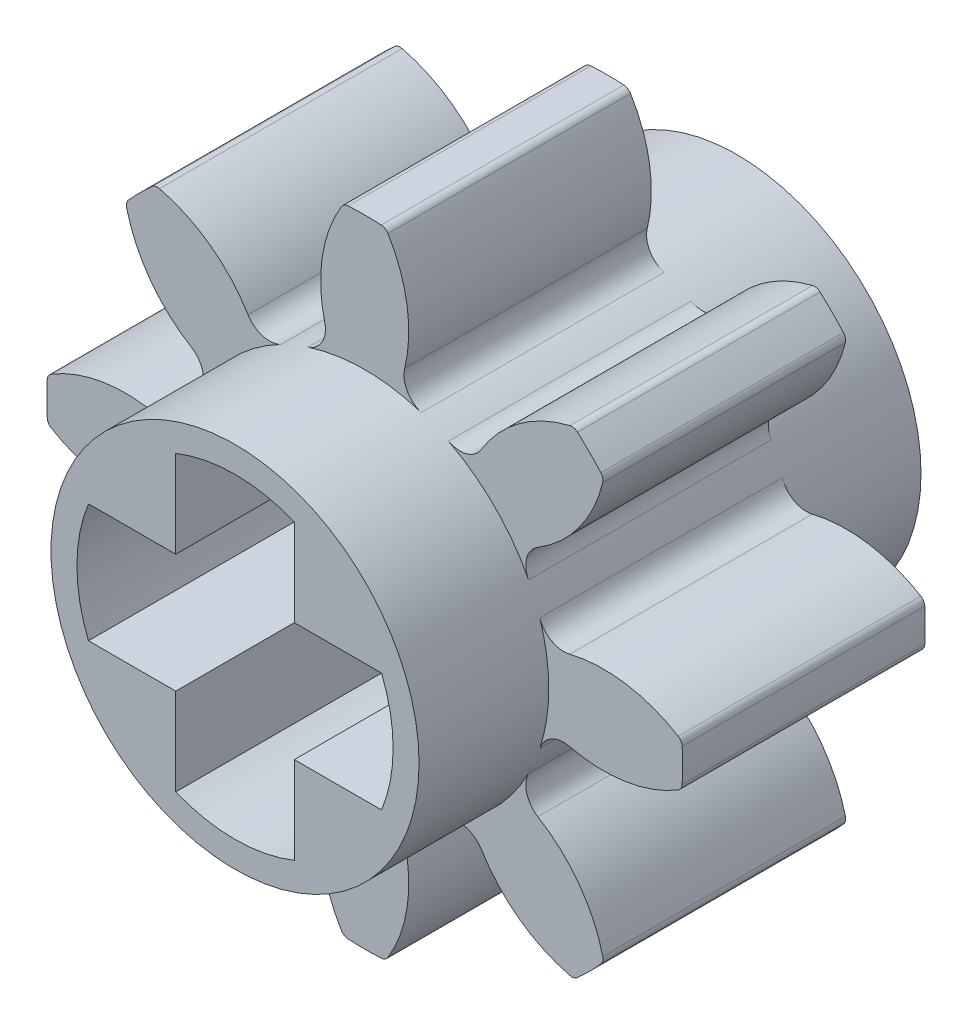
ISO-10303-21;
HEADER;
FILE_DESCRIPTION(('STEP AP214'),'2;1');
FILE_NAME('part.step','',(''),(''),'','','');
FILE_SCHEMA(('AUTOMOTIVE_DESIGN { 1 0 10303 214 1 1 1 1 }'));
ENDSEC;
DATA;
#1=APPLICATION_CONTEXT('core data for automotive mechanical design processes');
#2=APPLICATION_PROTOCOL_DEFINITION('international standard','automotive_design',2000,#1);
#3=PRODUCT_CONTEXT('',#1,'mechanical');
#4=PRODUCT('Part','Part','',(#3));
#5=PRODUCT_RELATED_PRODUCT_CATEGORY('part','',(#4));
#6=PRODUCT_DEFINITION_FORMATION('','',#4);
#7=PRODUCT_DEFINITION_CONTEXT('part definition',#1,'design');
#8=PRODUCT_DEFINITION('design','',#6,#7);
#9=PRODUCT_DEFINITION_SHAPE('','',#8);
#10=(LENGTH_UNIT() NAMED_UNIT(*) SI_UNIT(.MILLI.,.METRE.));
#11=(NAMED_UNIT(*) PLANE_ANGLE_UNIT() SI_UNIT($,.RADIAN.));
#12=(NAMED_UNIT(*) SI_UNIT($,.STERADIAN.) SOLID_ANGLE_UNIT());
#13=UNCERTAINTY_MEASURE_WITH_UNIT(LENGTH_MEASURE(1.E-05),#10,'distance_accuracy_value','');
#14=(GEOMETRIC_REPRESENTATION_CONTEXT(3) GLOBAL_UNCERTAINTY_ASSIGNED_CONTEXT((#13)) GLOBAL_UNIT_ASSIGNED_CONTEXT((#10,
#11,#12)) REPRESENTATION_CONTEXT('',''));
#15=CARTESIAN_POINT('',(0.,0.,0.));
#16=DIRECTION('',(0.,0.,1.));
#17=DIRECTION('',(1.,0.,0.));
#18=AXIS2_PLACEMENT_3D('',#15,#16,#17);
#19=CARTESIAN_POINT('',(0.,0.,3.81));
#20=DIRECTION('',(0.,0.,-1.));
#21=DIRECTION('',(-1.,0.,0.));
#22=AXIS2_PLACEMENT_3D('',#19,#20,#21);
#23=CYLINDRICAL_SURFACE('',#22,2.794);
#24=DIRECTION('',(0.,0.,-1.));
#25=VECTOR('',#24,1.);
#26=CARTESIAN_POINT('',(-2.4877726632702,1.27177953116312,3.81));
#27=LINE('',#26,#25);
#28=CARTESIAN_POINT('',(-2.4877726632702,1.27177953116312,1.8415));
#29=VERTEX_POINT('',#28);
#30=CARTESIAN_POINT('',(-2.4877726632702,1.27177953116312,-1.8415));
#31=VERTEX_POINT('',#30);
#32=EDGE_CURVE('E1075',#29,#31,#27,.T.);
#33=ORIENTED_EDGE('',*,*,#32,.T.);
#34=CARTESIAN_POINT('',(0.,0.,-1.8415));
#35=DIRECTION('',(0.,0.,1.));
#36=DIRECTION('',(0.707106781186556,0.707106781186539,0.));
#37=AXIS2_PLACEMENT_3D('',#34,#35,#36);
#38=CIRCLE('',#37,2.794);
#39=CARTESIAN_POINT('',(-1.27177953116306,2.48777266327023,-1.8415));
#40=VERTEX_POINT('',#39);
#41=EDGE_CURVE('E588',#40,#31,#38,.T.);
#42=ORIENTED_EDGE('',*,*,#41,.F.);
#43=DIRECTION('',(0.,0.,-1.));
#44=VECTOR('',#43,1.);
#45=CARTESIAN_POINT('',(-1.27177953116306,2.48777266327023,3.81));
#46=LINE('',#45,#44);
#47=CARTESIAN_POINT('',(-1.27177953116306,2.48777266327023,1.8415));
#48=VERTEX_POINT('',#47);
#49=EDGE_CURVE('E1072',#40,#48,#46,.F.);
#50=ORIENTED_EDGE('',*,*,#49,.T.);
#51=CARTESIAN_POINT('',(0.,0.,1.8415));
#52=DIRECTION('',(0.,0.,1.));
#53=DIRECTION('',(0.707106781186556,0.707106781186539,0.));
#54=AXIS2_PLACEMENT_3D('',#51,#52,#53);
#55=CIRCLE('',#54,2.794);
#56=EDGE_CURVE('E608',#48,#29,#55,.T.);
#57=ORIENTED_EDGE('',*,*,#56,.T.);
#58=EDGE_LOOP('',(#33,#42,#50,#57));
#59=FACE_BOUND('',#58,.T.);
#60=DIRECTION('',(0.,0.,-1.));
#61=VECTOR('',#60,1.);
#62=CARTESIAN_POINT('',(-2.65840485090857,-0.859836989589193,3.81));
#63=LINE('',#62,#61);
#64=CARTESIAN_POINT('',(-2.65840485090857,-0.859836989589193,1.8415));
#65=VERTEX_POINT('',#64);
#66=CARTESIAN_POINT('',(-2.65840485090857,-0.859836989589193,-1.8415));
#67=VERTEX_POINT('',#66);
#68=EDGE_CURVE('E1054',#65,#67,#63,.T.);
#69=ORIENTED_EDGE('',*,*,#68,.T.);
#70=CARTESIAN_POINT('',(0.,0.,-1.8415));
#71=DIRECTION('',(0.,0.,1.));
#72=DIRECTION('',(0.,1.,0.));
#73=AXIS2_PLACEMENT_3D('',#70,#71,#72);
#74=CIRCLE('',#73,2.794);
#75=CARTESIAN_POINT('',(-2.65840485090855,0.859836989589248,-1.8415));
#76=VERTEX_POINT('',#75);
#77=EDGE_CURVE('E618',#76,#67,#74,.T.);
#78=ORIENTED_EDGE('',*,*,#77,.F.);
#79=DIRECTION('',(0.,0.,-1.));
#80=VECTOR('',#79,1.);
#81=CARTESIAN_POINT('',(-2.65840485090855,0.859836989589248,3.81));
#82=LINE('',#81,#80);
#83=CARTESIAN_POINT('',(-2.65840485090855,0.859836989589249,1.8415));
#84=VERTEX_POINT('',#83);
#85=EDGE_CURVE('E1051',#76,#84,#82,.F.);
#86=ORIENTED_EDGE('',*,*,#85,.T.);
#87=CARTESIAN_POINT('',(0.,0.,1.8415));
#88=DIRECTION('',(0.,0.,1.));
#89=DIRECTION('',(0.,1.,0.));
#90=AXIS2_PLACEMENT_3D('',#87,#88,#89);
#91=CIRCLE('',#90,2.794);
#92=EDGE_CURVE('E626',#84,#65,#91,.T.);
#93=ORIENTED_EDGE('',*,*,#92,.T.);
#94=EDGE_LOOP('',(#69,#78,#86,#93));
#95=FACE_BOUND('',#94,.T.);
#96=DIRECTION('',(0.,0.,-1.));
#97=VECTOR('',#96,1.);
#98=CARTESIAN_POINT('',(-1.27177953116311,-2.48777266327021,3.81));
#99=LINE('',#98,#97);
#100=CARTESIAN_POINT('',(-1.27177953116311,-2.48777266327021,1.8415));
#101=VERTEX_POINT('',#100);
#102=CARTESIAN_POINT('',(-1.27177953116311,-2.48777266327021,-1.8415));
#103=VERTEX_POINT('',#102);
#104=EDGE_CURVE('E1033',#101,#103,#99,.T.);
#105=ORIENTED_EDGE('',*,*,#104,.T.);
#106=CARTESIAN_POINT('',(0.,0.,-1.8415));
#107=DIRECTION('',(0.,0.,1.));
#108=DIRECTION('',(-0.707106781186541,0.707106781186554,0.));
#109=AXIS2_PLACEMENT_3D('',#106,#107,#108);
#110=CIRCLE('',#109,2.794);
#111=CARTESIAN_POINT('',(-2.48777266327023,-1.27177953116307,-1.8415));
#112=VERTEX_POINT('',#111);
#113=EDGE_CURVE('E636',#112,#103,#110,.T.);
#114=ORIENTED_EDGE('',*,*,#113,.F.);
#115=DIRECTION('',(0.,0.,-1.));
#116=VECTOR('',#115,1.);
#117=CARTESIAN_POINT('',(-2.48777266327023,-1.27177953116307,3.81));
#118=LINE('',#117,#116);
#119=CARTESIAN_POINT('',(-2.48777266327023,-1.27177953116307,1.8415));
#120=VERTEX_POINT('',#119);
#121=EDGE_CURVE('E1030',#112,#120,#118,.F.);
#122=ORIENTED_EDGE('',*,*,#121,.T.);
#123=CARTESIAN_POINT('',(0.,0.,1.8415));
#124=DIRECTION('',(0.,0.,1.));
#125=DIRECTION('',(-0.707106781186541,0.707106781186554,0.));
#126=AXIS2_PLACEMENT_3D('',#123,#124,#125);
#127=CIRCLE('',#126,2.794);
#128=EDGE_CURVE('E644',#120,#101,#127,.T.);
#129=ORIENTED_EDGE('',*,*,#128,.T.);
#130=EDGE_LOOP('',(#105,#114,#122,#129));
#131=FACE_BOUND('',#130,.T.);
#132=DIRECTION('',(0.,0.,-1.));
#133=VECTOR('',#132,1.);
#134=CARTESIAN_POINT('',(0.859836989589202,-2.65840485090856,3.81));
#135=LINE('',#134,#133);
#136=CARTESIAN_POINT('',(0.859836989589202,-2.65840485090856,1.8415));
#137=VERTEX_POINT('',#136);
#138=CARTESIAN_POINT('',(0.859836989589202,-2.65840485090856,-1.8415));
#139=VERTEX_POINT('',#138);
#140=EDGE_CURVE('E1012',#137,#139,#135,.T.);
#141=ORIENTED_EDGE('',*,*,#140,.T.);
#142=CARTESIAN_POINT('',(0.,0.,-1.8415));
#143=DIRECTION('',(0.,0.,1.));
#144=DIRECTION('',(-1.,0.,0.));
#145=AXIS2_PLACEMENT_3D('',#142,#143,#144);
#146=CIRCLE('',#145,2.794);
#147=CARTESIAN_POINT('',(-0.859836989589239,-2.65840485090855,-1.8415));
#148=VERTEX_POINT('',#147);
#149=EDGE_CURVE('E654',#148,#139,#146,.T.);
#150=ORIENTED_EDGE('',*,*,#149,.F.);
#151=DIRECTION('',(0.,0.,-1.));
#152=VECTOR('',#151,1.);
#153=CARTESIAN_POINT('',(-0.859836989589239,-2.65840485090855,3.81));
#154=LINE('',#153,#152);
#155=CARTESIAN_POINT('',(-0.859836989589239,-2.65840485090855,1.8415));
#156=VERTEX_POINT('',#155);
#157=EDGE_CURVE('E1009',#148,#156,#154,.F.);
#158=ORIENTED_EDGE('',*,*,#157,.T.);
#159=CARTESIAN_POINT('',(0.,0.,1.8415));
#160=DIRECTION('',(0.,0.,1.));
#161=DIRECTION('',(-1.,0.,0.));
#162=AXIS2_PLACEMENT_3D('',#159,#160,#161);
#163=CIRCLE('',#162,2.794);
#164=EDGE_CURVE('E662',#156,#137,#163,.T.);
#165=ORIENTED_EDGE('',*,*,#164,.T.);
#166=EDGE_LOOP('',(#141,#150,#158,#165));
#167=FACE_BOUND('',#166,.T.);
#168=DIRECTION('',(0.,0.,-1.));
#169=VECTOR('',#168,1.);
#170=CARTESIAN_POINT('',(2.48777266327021,-1.2717795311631,3.81));
#171=LINE('',#170,#169);
#172=CARTESIAN_POINT('',(2.48777266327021,-1.2717795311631,1.8415));
#173=VERTEX_POINT('',#172);
#174=CARTESIAN_POINT('',(2.48777266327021,-1.2717795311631,-1.8415));
#175=VERTEX_POINT('',#174);
#176=EDGE_CURVE('E991',#173,#175,#171,.T.);
#177=ORIENTED_EDGE('',*,*,#176,.T.);
#178=CARTESIAN_POINT('',(0.,0.,-1.8415));
#179=DIRECTION('',(0.,0.,1.));
#180=DIRECTION('',(-0.707106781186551,-0.707106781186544,0.));
#181=AXIS2_PLACEMENT_3D('',#178,#179,#180);
#182=CIRCLE('',#181,2.794);
#183=CARTESIAN_POINT('',(1.27177953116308,-2.48777266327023,-1.8415));
#184=VERTEX_POINT('',#183);
#185=EDGE_CURVE('E672',#184,#175,#182,.T.);
#186=ORIENTED_EDGE('',*,*,#185,.F.);
#187=DIRECTION('',(0.,0.,-1.));
#188=VECTOR('',#187,1.);
#189=CARTESIAN_POINT('',(1.27177953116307,-2.48777266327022,3.81));
#190=LINE('',#189,#188);
#191=CARTESIAN_POINT('',(1.27177953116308,-2.48777266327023,1.8415));
#192=VERTEX_POINT('',#191);
#193=EDGE_CURVE('E988',#184,#192,#190,.F.);
#194=ORIENTED_EDGE('',*,*,#193,.T.);
#195=CARTESIAN_POINT('',(0.,0.,1.8415));
#196=DIRECTION('',(0.,0.,1.));
#197=DIRECTION('',(-0.707106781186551,-0.707106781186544,0.));
#198=AXIS2_PLACEMENT_3D('',#195,#196,#197);
#199=CIRCLE('',#198,2.794);
#200=EDGE_CURVE('E680',#192,#173,#199,.T.);
#201=ORIENTED_EDGE('',*,*,#200,.T.);
#202=EDGE_LOOP('',(#177,#186,#194,#201));
#203=FACE_BOUND('',#202,.T.);
#204=DIRECTION('',(0.,0.,-1.));
#205=VECTOR('',#204,1.);
#206=CARTESIAN_POINT('',(2.65840485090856,0.859836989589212,3.81));
#207=LINE('',#206,#205);
#208=CARTESIAN_POINT('',(2.65840485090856,0.859836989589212,1.8415));
#209=VERTEX_POINT('',#208);
#210=CARTESIAN_POINT('',(2.65840485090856,0.859836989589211,-1.8415));
#211=VERTEX_POINT('',#210);
#212=EDGE_CURVE('E970',#209,#211,#207,.T.);
#213=ORIENTED_EDGE('',*,*,#212,.T.);
#214=CARTESIAN_POINT('',(0.,0.,-1.8415));
#215=DIRECTION('',(0.,0.,1.));
#216=DIRECTION('',(0.,-1.,0.));
#217=AXIS2_PLACEMENT_3D('',#214,#215,#216);
#218=CIRCLE('',#217,2.794);
#219=CARTESIAN_POINT('',(2.65840485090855,-0.85983698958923,-1.8415));
#220=VERTEX_POINT('',#219);
#221=EDGE_CURVE('E690',#220,#211,#218,.T.);
#222=ORIENTED_EDGE('',*,*,#221,.F.);
#223=DIRECTION('',(0.,0.,-1.));
#224=VECTOR('',#223,1.);
#225=CARTESIAN_POINT('',(2.65840485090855,-0.85983698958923,3.81));
#226=LINE('',#225,#224);
#227=CARTESIAN_POINT('',(2.65840485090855,-0.85983698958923,1.8415));
#228=VERTEX_POINT('',#227);
#229=EDGE_CURVE('E967',#220,#228,#226,.F.);
#230=ORIENTED_EDGE('',*,*,#229,.T.);
#231=CARTESIAN_POINT('',(0.,0.,1.8415));
#232=DIRECTION('',(0.,0.,1.));
#233=DIRECTION('',(0.,-1.,0.));
#234=AXIS2_PLACEMENT_3D('',#231,#232,#233);
#235=CIRCLE('',#234,2.794);
#236=EDGE_CURVE('E698',#228,#209,#235,.T.);
#237=ORIENTED_EDGE('',*,*,#236,.T.);
#238=EDGE_LOOP('',(#213,#222,#230,#237));
#239=FACE_BOUND('',#238,.T.);
#240=DIRECTION('',(0.,0.,-1.));
#241=VECTOR('',#240,1.);
#242=CARTESIAN_POINT('',(1.27177953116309,2.48777266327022,3.81));
#243=LINE('',#242,#241);
#244=CARTESIAN_POINT('',(1.27177953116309,2.48777266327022,1.8415));
#245=VERTEX_POINT('',#244);
#246=CARTESIAN_POINT('',(1.27177953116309,2.48777266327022,-1.8415));
#247=VERTEX_POINT('',#246);
#248=EDGE_CURVE('E949',#245,#247,#243,.T.);
#249=ORIENTED_EDGE('',*,*,#248,.T.);
#250=CARTESIAN_POINT('',(0.,0.,-1.8415));
#251=DIRECTION('',(0.,0.,1.));
#252=DIRECTION('',(0.707106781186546,-0.707106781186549,0.));
#253=AXIS2_PLACEMENT_3D('',#250,#251,#252);
#254=CIRCLE('',#253,2.794);
#255=CARTESIAN_POINT('',(2.48777266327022,1.27177953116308,-1.8415));
#256=VERTEX_POINT('',#255);
#257=EDGE_CURVE('E708',#256,#247,#254,.T.);
#258=ORIENTED_EDGE('',*,*,#257,.F.);
#259=DIRECTION('',(0.,0.,-1.));
#260=VECTOR('',#259,1.);
#261=CARTESIAN_POINT('',(2.48777266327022,1.27177953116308,3.81));
#262=LINE('',#261,#260);
#263=CARTESIAN_POINT('',(2.48777266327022,1.27177953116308,1.8415));
#264=VERTEX_POINT('',#263);
#265=EDGE_CURVE('E946',#256,#264,#262,.F.);
#266=ORIENTED_EDGE('',*,*,#265,.T.);
#267=CARTESIAN_POINT('',(0.,0.,1.8415));
#268=DIRECTION('',(0.,0.,1.));
#269=DIRECTION('',(0.707106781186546,-0.707106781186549,0.));
#270=AXIS2_PLACEMENT_3D('',#267,#268,#269);
#271=CIRCLE('',#270,2.794);
#272=EDGE_CURVE('E716',#264,#245,#271,.T.);
#273=ORIENTED_EDGE('',*,*,#272,.T.);
#274=EDGE_LOOP('',(#249,#258,#266,#273));
#275=FACE_BOUND('',#274,.T.);
#276=DIRECTION('',(0.,0.,-1.));
#277=VECTOR('',#276,1.);
#278=CARTESIAN_POINT('',(-0.85983698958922,2.65840485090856,3.81));
#279=LINE('',#278,#277);
#280=CARTESIAN_POINT('',(-0.85983698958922,2.65840485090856,1.8415));
#281=VERTEX_POINT('',#280);
#282=CARTESIAN_POINT('',(-0.85983698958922,2.65840485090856,-1.8415));
#283=VERTEX_POINT('',#282);
#284=EDGE_CURVE('E781',#281,#283,#279,.T.);
#285=ORIENTED_EDGE('',*,*,#284,.T.);
#286=CARTESIAN_POINT('',(0.,0.,-1.8415));
#287=DIRECTION('',(0.,0.,1.));
#288=DIRECTION('',(1.,0.,0.));
#289=AXIS2_PLACEMENT_3D('',#286,#287,#288);
#290=CIRCLE('',#289,2.794);
#291=CARTESIAN_POINT('',(0.859836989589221,2.65840485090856,-1.8415));
#292=VERTEX_POINT('',#291);
#293=EDGE_CURVE('E726',#292,#283,#290,.T.);
#294=ORIENTED_EDGE('',*,*,#293,.F.);
#295=DIRECTION('',(0.,0.,-1.));
#296=VECTOR('',#295,1.);
#297=CARTESIAN_POINT('',(0.859836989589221,2.65840485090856,3.81));
#298=LINE('',#297,#296);
#299=CARTESIAN_POINT('',(0.859836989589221,2.65840485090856,1.8415));
#300=VERTEX_POINT('',#299);
#301=EDGE_CURVE('E778',#292,#300,#298,.F.);
#302=ORIENTED_EDGE('',*,*,#301,.T.);
#303=CARTESIAN_POINT('',(0.,0.,1.8415));
#304=DIRECTION('',(0.,0.,1.));
#305=DIRECTION('',(1.,0.,0.));
#306=AXIS2_PLACEMENT_3D('',#303,#304,#305);
#307=CIRCLE('',#306,2.794);
#308=EDGE_CURVE('E742',#300,#281,#307,.T.);
#309=ORIENTED_EDGE('',*,*,#308,.T.);
#310=EDGE_LOOP('',(#285,#294,#302,#309));
#311=FACE_BOUND('',#310,.T.);
#312=CARTESIAN_POINT('',(0.,0.,3.81));
#313=DIRECTION('',(0.,0.,1.));
#314=DIRECTION('',(1.,0.,0.));
#315=AXIS2_PLACEMENT_3D('',#312,#313,#314);
#316=CIRCLE('',#315,2.794);
#317=CARTESIAN_POINT('',(2.794,0.,3.81));
#318=VERTEX_POINT('',#317);
#319=EDGE_CURVE('E754',#318,#318,#316,.T.);
#320=ORIENTED_EDGE('',*,*,#319,.F.);
#321=EDGE_LOOP('',(#320));
#322=FACE_BOUND('',#321,.T.);
#323=CARTESIAN_POINT('',(0.,0.,-3.81));
#324=DIRECTION('',(0.,0.,1.));
#325=DIRECTION('',(1.,0.,0.));
#326=AXIS2_PLACEMENT_3D('',#323,#324,#325);
#327=CIRCLE('',#326,2.794);
#328=CARTESIAN_POINT('',(2.794,0.,-3.81));
#329=VERTEX_POINT('',#328);
#330=EDGE_CURVE('E751',#329,#329,#327,.T.);
#331=ORIENTED_EDGE('',*,*,#330,.T.);
#332=EDGE_LOOP('',(#331));
#333=FACE_BOUND('',#332,.T.);
#334=ADVANCED_FACE('F35',(#59,#95,#131,#167,#203,#239,#275,#311,#322,#333),#23,.T.);
#335=CARTESIAN_POINT('',(0.,0.,3.81));
#336=DIRECTION('',(0.,0.,1.));
#337=DIRECTION('',(1.,0.,0.));
#338=AXIS2_PLACEMENT_3D('',#335,#336,#337);
#339=PLANE('',#338);
#340=CARTESIAN_POINT('',(0.,0.,3.81));
#341=DIRECTION('',(0.,0.,1.));
#342=DIRECTION('',(1.,0.,0.));
#343=AXIS2_PLACEMENT_3D('',#340,#341,#342);
#344=CIRCLE('',#343,2.4);
#345=CARTESIAN_POINT('',(2.2248595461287,-0.9,3.81));
#346=VERTEX_POINT('',#345);
#347=CARTESIAN_POINT('',(2.2248595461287,0.9,3.81));
#348=VERTEX_POINT('',#347);
#349=EDGE_CURVE('E50',#346,#348,#344,.T.);
#350=ORIENTED_EDGE('',*,*,#349,.F.);
#351=DIRECTION('',(1.,0.,0.));
#352=VECTOR('',#351,1.);
#353=CARTESIAN_POINT('',(0.9,-0.9,3.81));
#354=LINE('',#353,#352);
#355=CARTESIAN_POINT('',(0.9,-0.9,3.81));
#356=VERTEX_POINT('',#355);
#357=EDGE_CURVE('E526',#356,#346,#354,.T.);
#358=ORIENTED_EDGE('',*,*,#357,.F.);
#359=DIRECTION('',(0.,1.,0.));
#360=VECTOR('',#359,1.);
#361=CARTESIAN_POINT('',(0.9,-0.9,3.81));
#362=LINE('',#361,#360);
#363=CARTESIAN_POINT('',(0.900000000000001,-2.2248595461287,3.81));
#364=VERTEX_POINT('',#363);
#365=EDGE_CURVE('E529',#364,#356,#362,.T.);
#366=ORIENTED_EDGE('',*,*,#365,.F.);
#367=CARTESIAN_POINT('',(0.,0.,3.81));
#368=DIRECTION('',(0.,0.,1.));
#369=DIRECTION('',(1.,0.,0.));
#370=AXIS2_PLACEMENT_3D('',#367,#368,#369);
#371=CIRCLE('',#370,2.4);
#372=CARTESIAN_POINT('',(-0.9,-2.2248595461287,3.81));
#373=VERTEX_POINT('',#372);
#374=EDGE_CURVE('E581',#373,#364,#371,.T.);
#375=ORIENTED_EDGE('',*,*,#374,.F.);
#376=DIRECTION('',(0.,-1.,0.));
#377=VECTOR('',#376,1.);
#378=CARTESIAN_POINT('',(-0.899999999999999,-0.9,3.81));
#379=LINE('',#378,#377);
#380=CARTESIAN_POINT('',(-0.899999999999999,-0.9,3.81));
#381=VERTEX_POINT('',#380);
#382=EDGE_CURVE('E578',#381,#373,#379,.T.);
#383=ORIENTED_EDGE('',*,*,#382,.F.);
#384=DIRECTION('',(1.,0.,0.));
#385=VECTOR('',#384,1.);
#386=CARTESIAN_POINT('',(-2.2248595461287,-0.9,3.81));
#387=LINE('',#386,#385);
#388=CARTESIAN_POINT('',(-2.2248595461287,-0.9,3.81));
#389=VERTEX_POINT('',#388);
#390=EDGE_CURVE('E575',#389,#381,#387,.T.);
#391=ORIENTED_EDGE('',*,*,#390,.F.);
#392=CARTESIAN_POINT('',(0.,0.,3.81));
#393=DIRECTION('',(0.,0.,1.));
#394=DIRECTION('',(1.,0.,0.));
#395=AXIS2_PLACEMENT_3D('',#392,#393,#394);
#396=CIRCLE('',#395,2.4);
#397=CARTESIAN_POINT('',(-2.2248595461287,0.9,3.81));
#398=VERTEX_POINT('',#397);
#399=EDGE_CURVE('E572',#398,#389,#396,.T.);
#400=ORIENTED_EDGE('',*,*,#399,.F.);
#401=DIRECTION('',(-1.,0.,0.));
#402=VECTOR('',#401,1.);
#403=CARTESIAN_POINT('',(-2.2248595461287,0.9,3.81));
#404=LINE('',#403,#402);
#405=CARTESIAN_POINT('',(-0.9,0.9,3.81));
#406=VERTEX_POINT('',#405);
#407=EDGE_CURVE('E569',#406,#398,#404,.T.);
#408=ORIENTED_EDGE('',*,*,#407,.F.);
#409=DIRECTION('',(0.,-1.,0.));
#410=VECTOR('',#409,1.);
#411=CARTESIAN_POINT('',(-0.9,2.2248595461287,3.81));
#412=LINE('',#411,#410);
#413=CARTESIAN_POINT('',(-0.9,2.2248595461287,3.81));
#414=VERTEX_POINT('',#413);
#415=EDGE_CURVE('E566',#414,#406,#412,.T.);
#416=ORIENTED_EDGE('',*,*,#415,.F.);
#417=CARTESIAN_POINT('',(0.,0.,3.81));
#418=DIRECTION('',(0.,0.,1.));
#419=DIRECTION('',(1.,0.,0.));
#420=AXIS2_PLACEMENT_3D('',#417,#418,#419);
#421=CIRCLE('',#420,2.4);
#422=CARTESIAN_POINT('',(0.9,2.2248595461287,3.81));
#423=VERTEX_POINT('',#422);
#424=EDGE_CURVE('E563',#423,#414,#421,.T.);
#425=ORIENTED_EDGE('',*,*,#424,.F.);
#426=DIRECTION('',(0.,1.,0.));
#427=VECTOR('',#426,1.);
#428=CARTESIAN_POINT('',(0.9,2.2248595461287,3.81));
#429=LINE('',#428,#427);
#430=CARTESIAN_POINT('',(0.9,0.9,3.81));
#431=VERTEX_POINT('',#430);
#432=EDGE_CURVE('E560',#431,#423,#429,.T.);
#433=ORIENTED_EDGE('',*,*,#432,.F.);
#434=DIRECTION('',(-1.,0.,0.));
#435=VECTOR('',#434,1.);
#436=CARTESIAN_POINT('',(0.9,0.9,3.81));
#437=LINE('',#436,#435);
#438=EDGE_CURVE('E558',#348,#431,#437,.T.);
#439=ORIENTED_EDGE('',*,*,#438,.F.);
#440=EDGE_LOOP('',(#350,#358,#366,#375,#383,#391,#400,#408,#416,#425,#433,#439));
#441=FACE_BOUND('',#440,.T.);
#442=ORIENTED_EDGE('',*,*,#319,.T.);
#443=EDGE_LOOP('',(#442));
#444=FACE_BOUND('',#443,.T.);
#445=ADVANCED_FACE('F1138',(#441,#444),#339,.T.);
#446=CARTESIAN_POINT('',(0.,0.,-3.81));
#447=DIRECTION('',(0.,0.,1.));
#448=DIRECTION('',(1.,0.,0.));
#449=AXIS2_PLACEMENT_3D('',#446,#447,#448);
#450=PLANE('',#449);
#451=DIRECTION('',(1.,0.,0.));
#452=VECTOR('',#451,1.);
#453=CARTESIAN_POINT('',(0.9,-0.9,-3.81));
#454=LINE('',#453,#452);
#455=CARTESIAN_POINT('',(0.9,-0.9,-3.81));
#456=VERTEX_POINT('',#455);
#457=CARTESIAN_POINT('',(2.2248595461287,-0.9,-3.81));
#458=VERTEX_POINT('',#457);
#459=EDGE_CURVE('E515',#456,#458,#454,.T.);
#460=ORIENTED_EDGE('',*,*,#459,.T.);
#461=CARTESIAN_POINT('',(0.,0.,-3.81));
#462=DIRECTION('',(0.,0.,1.));
#463=DIRECTION('',(1.,0.,0.));
#464=AXIS2_PLACEMENT_3D('',#461,#462,#463);
#465=CIRCLE('',#464,2.4);
#466=CARTESIAN_POINT('',(2.2248595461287,0.9,-3.81));
#467=VERTEX_POINT('',#466);
#468=EDGE_CURVE('E509',#458,#467,#465,.T.);
#469=ORIENTED_EDGE('',*,*,#468,.T.);
#470=DIRECTION('',(-1.,0.,0.));
#471=VECTOR('',#470,1.);
#472=CARTESIAN_POINT('',(0.9,0.9,-3.81));
#473=LINE('',#472,#471);
#474=CARTESIAN_POINT('',(0.9,0.9,-3.81));
#475=VERTEX_POINT('',#474);
#476=EDGE_CURVE('E518',#467,#475,#473,.T.);
#477=ORIENTED_EDGE('',*,*,#476,.T.);
#478=DIRECTION('',(0.,1.,0.));
#479=VECTOR('',#478,1.);
#480=CARTESIAN_POINT('',(0.9,2.2248595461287,-3.81));
#481=LINE('',#480,#479);
#482=CARTESIAN_POINT('',(0.9,2.2248595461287,-3.81));
#483=VERTEX_POINT('',#482);
#484=EDGE_CURVE('E58',#475,#483,#481,.T.);
#485=ORIENTED_EDGE('',*,*,#484,.T.);
#486=CARTESIAN_POINT('',(0.,0.,-3.81));
#487=DIRECTION('',(0.,0.,1.));
#488=DIRECTION('',(1.,0.,0.));
#489=AXIS2_PLACEMENT_3D('',#486,#487,#488);
#490=CIRCLE('',#489,2.4);
#491=CARTESIAN_POINT('',(-0.9,2.2248595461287,-3.81));
#492=VERTEX_POINT('',#491);
#493=EDGE_CURVE('E533',#483,#492,#490,.T.);
#494=ORIENTED_EDGE('',*,*,#493,.T.);
#495=DIRECTION('',(0.,-1.,0.));
#496=VECTOR('',#495,1.);
#497=CARTESIAN_POINT('',(-0.9,2.2248595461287,-3.81));
#498=LINE('',#497,#496);
#499=CARTESIAN_POINT('',(-0.9,0.9,-3.81));
#500=VERTEX_POINT('',#499);
#501=EDGE_CURVE('E536',#492,#500,#498,.T.);
#502=ORIENTED_EDGE('',*,*,#501,.T.);
#503=DIRECTION('',(-1.,0.,0.));
#504=VECTOR('',#503,1.);
#505=CARTESIAN_POINT('',(-2.2248595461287,0.9,-3.81));
#506=LINE('',#505,#504);
#507=CARTESIAN_POINT('',(-2.2248595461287,0.9,-3.81));
#508=VERTEX_POINT('',#507);
#509=EDGE_CURVE('E539',#500,#508,#506,.T.);
#510=ORIENTED_EDGE('',*,*,#509,.T.);
#511=CARTESIAN_POINT('',(0.,0.,-3.81));
#512=DIRECTION('',(0.,0.,1.));
#513=DIRECTION('',(1.,0.,0.));
#514=AXIS2_PLACEMENT_3D('',#511,#512,#513);
#515=CIRCLE('',#514,2.4);
#516=CARTESIAN_POINT('',(-2.2248595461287,-0.9,-3.81));
#517=VERTEX_POINT('',#516);
#518=EDGE_CURVE('E542',#508,#517,#515,.T.);
#519=ORIENTED_EDGE('',*,*,#518,.T.);
#520=DIRECTION('',(1.,0.,0.));
#521=VECTOR('',#520,1.);
#522=CARTESIAN_POINT('',(-2.2248595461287,-0.9,-3.81));
#523=LINE('',#522,#521);
#524=CARTESIAN_POINT('',(-0.899999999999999,-0.9,-3.81));
#525=VERTEX_POINT('',#524);
#526=EDGE_CURVE('E545',#517,#525,#523,.T.);
#527=ORIENTED_EDGE('',*,*,#526,.T.);
#528=DIRECTION('',(0.,-1.,0.));
#529=VECTOR('',#528,1.);
#530=CARTESIAN_POINT('',(-0.899999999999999,-0.9,-3.81));
#531=LINE('',#530,#529);
#532=CARTESIAN_POINT('',(-0.9,-2.2248595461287,-3.81));
#533=VERTEX_POINT('',#532);
#534=EDGE_CURVE('E548',#525,#533,#531,.T.);
#535=ORIENTED_EDGE('',*,*,#534,.T.);
#536=CARTESIAN_POINT('',(0.,0.,-3.81));
#537=DIRECTION('',(0.,0.,1.));
#538=DIRECTION('',(1.,0.,0.));
#539=AXIS2_PLACEMENT_3D('',#536,#537,#538);
#540=CIRCLE('',#539,2.4);
#541=CARTESIAN_POINT('',(0.900000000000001,-2.2248595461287,-3.81));
#542=VERTEX_POINT('',#541);
#543=EDGE_CURVE('E551',#533,#542,#540,.T.);
#544=ORIENTED_EDGE('',*,*,#543,.T.);
#545=DIRECTION('',(0.,1.,0.));
#546=VECTOR('',#545,1.);
#547=CARTESIAN_POINT('',(0.9,-0.9,-3.81));
#548=LINE('',#547,#546);
#549=EDGE_CURVE('E554',#542,#456,#548,.T.);
#550=ORIENTED_EDGE('',*,*,#549,.T.);
#551=EDGE_LOOP('',(#460,#469,#477,#485,#494,#502,#510,#519,#527,#535,#544,#550));
#552=FACE_BOUND('',#551,.T.);
#553=ORIENTED_EDGE('',*,*,#330,.F.);
#554=EDGE_LOOP('',(#553));
#555=FACE_BOUND('',#554,.T.);
#556=ADVANCED_FACE('F522',(#552,#555),#450,.F.);
#557=CARTESIAN_POINT('',(-1.51185175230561,3.62812657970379,1.8415));
#558=DIRECTION('',(0.,0.,-1.));
#559=DIRECTION('',(-1.,0.,0.));
#560=AXIS2_PLACEMENT_3D('',#557,#558,#559);
#561=CYLINDRICAL_SURFACE('',#560,2.18093772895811);
#562=CARTESIAN_POINT('',(-1.51185175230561,3.62812657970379,1.8415));
#563=DIRECTION('',(0.,0.,1.));
#564=DIRECTION('',(1.,0.,0.));
#565=AXIS2_PLACEMENT_3D('',#562,#563,#564);
#566=CIRCLE('',#565,2.18093772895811);
#567=CARTESIAN_POINT('',(0.606943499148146,3.11121647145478,1.8415));
#568=VERTEX_POINT('',#567);
#569=CARTESIAN_POINT('',(0.353321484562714,4.75844431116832,1.8415));
#570=VERTEX_POINT('',#569);
#571=EDGE_CURVE('E749',#568,#570,#566,.T.);
#572=ORIENTED_EDGE('',*,*,#571,.F.);
#573=DIRECTION('',(0.,0.,-1.));
#574=VECTOR('',#573,1.);
#575=CARTESIAN_POINT('',(0.606943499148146,3.11121647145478,1.8415));
#576=LINE('',#575,#574);
#577=CARTESIAN_POINT('',(0.606943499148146,3.11121647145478,-1.8415));
#578=VERTEX_POINT('',#577);
#579=EDGE_CURVE('E786',#568,#578,#576,.T.);
#580=ORIENTED_EDGE('',*,*,#579,.T.);
#581=CARTESIAN_POINT('',(-1.51185175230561,3.62812657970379,-1.8415));
#582=DIRECTION('',(0.,0.,1.));
#583=DIRECTION('',(1.,0.,0.));
#584=AXIS2_PLACEMENT_3D('',#581,#582,#583);
#585=CIRCLE('',#584,2.18093772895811);
#586=CARTESIAN_POINT('',(0.353321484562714,4.75844431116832,-1.8415));
#587=VERTEX_POINT('',#586);
#588=EDGE_CURVE('E740',#578,#587,#585,.T.);
#589=ORIENTED_EDGE('',*,*,#588,.T.);
#590=DIRECTION('',(0.,0.,-1.));
#591=VECTOR('',#590,1.);
#592=CARTESIAN_POINT('',(0.353321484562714,4.75844431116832,1.8415));
#593=LINE('',#592,#591);
#594=EDGE_CURVE('E767',#587,#570,#593,.F.);
#595=ORIENTED_EDGE('',*,*,#594,.T.);
#596=EDGE_LOOP('',(#572,#580,#589,#595));
#597=FACE_BOUND('',#596,.T.);
#598=ADVANCED_FACE('F1321',(#597),#561,.T.);
#599=CARTESIAN_POINT('',(0.,0.,1.8415));
#600=DIRECTION('',(0.,0.,-1.));
#601=DIRECTION('',(-1.,0.,0.));
#602=AXIS2_PLACEMENT_3D('',#599,#600,#601);
#603=CYLINDRICAL_SURFACE('',#602,4.826);
#604=CARTESIAN_POINT('',(0.,0.,1.8415));
#605=DIRECTION('',(0.,0.,1.));
#606=DIRECTION('',(1.,0.,0.));
#607=AXIS2_PLACEMENT_3D('',#604,#605,#606);
#608=CIRCLE('',#607,4.826);
#609=CARTESIAN_POINT('',(0.251322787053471,4.81945150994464,1.8415));
#610=VERTEX_POINT('',#609);
#611=CARTESIAN_POINT('',(-0.251322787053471,4.81945150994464,1.8415));
#612=VERTEX_POINT('',#611);
#613=EDGE_CURVE('E746',#610,#612,#608,.T.);
#614=ORIENTED_EDGE('',*,*,#613,.F.);
#615=DIRECTION('',(0.,0.,-1.));
#616=VECTOR('',#615,1.);
#617=CARTESIAN_POINT('',(0.251322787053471,4.81945150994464,1.8415));
#618=LINE('',#617,#616);
#619=CARTESIAN_POINT('',(0.251322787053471,4.81945150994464,-1.8415));
#620=VERTEX_POINT('',#619);
#621=EDGE_CURVE('E759',#610,#620,#618,.T.);
#622=ORIENTED_EDGE('',*,*,#621,.T.);
#623=CARTESIAN_POINT('',(0.,0.,-1.8415));
#624=DIRECTION('',(0.,0.,1.));
#625=DIRECTION('',(1.,0.,0.));
#626=AXIS2_PLACEMENT_3D('',#623,#624,#625);
#627=CIRCLE('',#626,4.826);
#628=CARTESIAN_POINT('',(-0.251322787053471,4.81945150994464,-1.8415));
#629=VERTEX_POINT('',#628);
#630=EDGE_CURVE('E737',#620,#629,#627,.T.);
#631=ORIENTED_EDGE('',*,*,#630,.T.);
#632=DIRECTION('',(0.,0.,-1.));
#633=VECTOR('',#632,1.);
#634=CARTESIAN_POINT('',(-0.251322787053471,4.81945150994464,1.8415));
#635=LINE('',#634,#633);
#636=EDGE_CURVE('E757',#629,#612,#635,.F.);
#637=ORIENTED_EDGE('',*,*,#636,.T.);
#638=EDGE_LOOP('',(#614,#622,#631,#637));
#639=FACE_BOUND('',#638,.T.);
#640=ADVANCED_FACE('F1325',(#639),#603,.T.);
#641=CARTESIAN_POINT('',(1.51185175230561,3.62812657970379,1.8415));
#642=DIRECTION('',(0.,0.,-1.));
#643=DIRECTION('',(-1.,0.,0.));
#644=AXIS2_PLACEMENT_3D('',#641,#642,#643);
#645=CYLINDRICAL_SURFACE('',#644,2.18093772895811);
#646=CARTESIAN_POINT('',(1.51185175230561,3.62812657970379,-1.8415));
#647=DIRECTION('',(0.,0.,-1.));
#648=DIRECTION('',(-1.,0.,0.));
#649=AXIS2_PLACEMENT_3D('',#646,#647,#648);
#650=CIRCLE('',#649,2.18093772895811);
#651=CARTESIAN_POINT('',(-0.606943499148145,3.11121647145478,-1.8415));
#652=VERTEX_POINT('',#651);
#653=CARTESIAN_POINT('',(-0.353321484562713,4.75844431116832,-1.8415));
#654=VERTEX_POINT('',#653);
#655=EDGE_CURVE('E735',#652,#654,#650,.T.);
#656=ORIENTED_EDGE('',*,*,#655,.F.);
#657=DIRECTION('',(0.,0.,-1.));
#658=VECTOR('',#657,1.);
#659=CARTESIAN_POINT('',(-0.606943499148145,3.11121647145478,1.8415));
#660=LINE('',#659,#658);
#661=CARTESIAN_POINT('',(-0.606943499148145,3.11121647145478,1.8415));
#662=VERTEX_POINT('',#661);
#663=EDGE_CURVE('E784',#652,#662,#660,.F.);
#664=ORIENTED_EDGE('',*,*,#663,.T.);
#665=CARTESIAN_POINT('',(1.51185175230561,3.62812657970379,1.8415));
#666=DIRECTION('',(0.,0.,-1.));
#667=DIRECTION('',(-1.,0.,0.));
#668=AXIS2_PLACEMENT_3D('',#665,#666,#667);
#669=CIRCLE('',#668,2.18093772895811);
#670=CARTESIAN_POINT('',(-0.353321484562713,4.75844431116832,1.8415));
#671=VERTEX_POINT('',#670);
#672=EDGE_CURVE('E744',#662,#671,#669,.T.);
#673=ORIENTED_EDGE('',*,*,#672,.T.);
#674=DIRECTION('',(0.,0.,-1.));
#675=VECTOR('',#674,1.);
#676=CARTESIAN_POINT('',(-0.353321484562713,4.75844431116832,1.8415));
#677=LINE('',#676,#675);
#678=EDGE_CURVE('E775',#671,#654,#677,.T.);
#679=ORIENTED_EDGE('',*,*,#678,.T.);
#680=EDGE_LOOP('',(#656,#664,#673,#679));
#681=FACE_BOUND('',#680,.T.);
#682=ADVANCED_FACE('F1329',(#681),#645,.T.);
#683=CARTESIAN_POINT('',(0.755925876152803,1.81406328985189,1.8415));
#684=DIRECTION('',(0.,0.,1.));
#685=DIRECTION('',(1.,0.,0.));
#686=AXIS2_PLACEMENT_3D('',#683,#684,#685);
#687=PLANE('',#686);
#688=ORIENTED_EDGE('',*,*,#308,.F.);
#689=CARTESIAN_POINT('',(0.977087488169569,3.02091460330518,1.8415));
#690=DIRECTION('',(0.,0.,1.));
#691=DIRECTION('',(1.,0.,0.));
#692=AXIS2_PLACEMENT_3D('',#689,#690,#691);
#693=CIRCLE('',#692,0.381);
#694=EDGE_CURVE('E797',#300,#568,#693,.F.);
#695=ORIENTED_EDGE('',*,*,#694,.T.);
#696=ORIENTED_EDGE('',*,*,#571,.T.);
#697=CARTESIAN_POINT('',(0.244709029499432,4.69262383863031,1.8415));
#698=DIRECTION('',(0.,0.,1.));
#699=DIRECTION('',(1.,0.,0.));
#700=AXIS2_PLACEMENT_3D('',#697,#698,#699);
#701=CIRCLE('',#700,0.127);
#702=EDGE_CURVE('E773',#570,#610,#701,.T.);
#703=ORIENTED_EDGE('',*,*,#702,.T.);
#704=ORIENTED_EDGE('',*,*,#613,.T.);
#705=CARTESIAN_POINT('',(-0.244709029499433,4.69262383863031,1.8415));
#706=DIRECTION('',(0.,0.,1.));
#707=DIRECTION('',(1.,0.,0.));
#708=AXIS2_PLACEMENT_3D('',#705,#706,#707);
#709=CIRCLE('',#708,0.127);
#710=EDGE_CURVE('E770',#612,#671,#709,.T.);
#711=ORIENTED_EDGE('',*,*,#710,.T.);
#712=ORIENTED_EDGE('',*,*,#672,.F.);
#713=CARTESIAN_POINT('',(-0.977087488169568,3.02091460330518,1.8415));
#714=DIRECTION('',(0.,0.,1.));
#715=DIRECTION('',(1.,0.,0.));
#716=AXIS2_PLACEMENT_3D('',#713,#714,#715);
#717=CIRCLE('',#716,0.381);
#718=EDGE_CURVE('E791',#662,#281,#717,.F.);
#719=ORIENTED_EDGE('',*,*,#718,.T.);
#720=EDGE_LOOP('',(#688,#695,#696,#703,#704,#711,#712,#719));
#721=FACE_BOUND('',#720,.T.);
#722=ADVANCED_FACE('F1332',(#721),#687,.T.);
#723=CARTESIAN_POINT('',(0.755925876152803,1.81406328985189,-1.8415));
#724=DIRECTION('',(0.,0.,1.));
#725=DIRECTION('',(1.,0.,0.));
#726=AXIS2_PLACEMENT_3D('',#723,#724,#725);
#727=PLANE('',#726);
#728=ORIENTED_EDGE('',*,*,#630,.F.);
#729=CARTESIAN_POINT('',(0.244709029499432,4.69262383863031,-1.8415));
#730=DIRECTION('',(0.,0.,1.));
#731=DIRECTION('',(1.,0.,0.));
#732=AXIS2_PLACEMENT_3D('',#729,#730,#731);
#733=CIRCLE('',#732,0.127);
#734=EDGE_CURVE('E764',#620,#587,#733,.F.);
#735=ORIENTED_EDGE('',*,*,#734,.T.);
#736=ORIENTED_EDGE('',*,*,#588,.F.);
#737=CARTESIAN_POINT('',(0.977087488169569,3.02091460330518,-1.8415));
#738=DIRECTION('',(0.,0.,1.));
#739=DIRECTION('',(1.,0.,0.));
#740=AXIS2_PLACEMENT_3D('',#737,#738,#739);
#741=CIRCLE('',#740,0.381);
#742=EDGE_CURVE('E794',#578,#292,#741,.T.);
#743=ORIENTED_EDGE('',*,*,#742,.T.);
#744=ORIENTED_EDGE('',*,*,#293,.T.);
#745=CARTESIAN_POINT('',(-0.977087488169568,3.02091460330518,-1.8415));
#746=DIRECTION('',(0.,0.,1.));
#747=DIRECTION('',(1.,0.,0.));
#748=AXIS2_PLACEMENT_3D('',#745,#746,#747);
#749=CIRCLE('',#748,0.381);
#750=EDGE_CURVE('E789',#283,#652,#749,.T.);
#751=ORIENTED_EDGE('',*,*,#750,.T.);
#752=ORIENTED_EDGE('',*,*,#655,.T.);
#753=CARTESIAN_POINT('',(-0.244709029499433,4.69262383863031,-1.8415));
#754=DIRECTION('',(0.,0.,1.));
#755=DIRECTION('',(1.,0.,0.));
#756=AXIS2_PLACEMENT_3D('',#753,#754,#755);
#757=CIRCLE('',#756,0.127);
#758=EDGE_CURVE('E762',#654,#629,#757,.F.);
#759=ORIENTED_EDGE('',*,*,#758,.T.);
#760=EDGE_LOOP('',(#728,#735,#736,#743,#744,#751,#752,#759));
#761=FACE_BOUND('',#760,.T.);
#762=ADVANCED_FACE('F1339',(#761),#727,.F.);
#763=CARTESIAN_POINT('',(0.244709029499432,4.69262383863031,1.8415));
#764=DIRECTION('',(0.,0.,-1.));
#765=DIRECTION('',(-1.,0.,0.));
#766=AXIS2_PLACEMENT_3D('',#763,#764,#765);
#767=CYLINDRICAL_SURFACE('',#766,0.127);
#768=ORIENTED_EDGE('',*,*,#702,.F.);
#769=ORIENTED_EDGE('',*,*,#594,.F.);
#770=ORIENTED_EDGE('',*,*,#734,.F.);
#771=ORIENTED_EDGE('',*,*,#621,.F.);
#772=EDGE_LOOP('',(#768,#769,#770,#771));
#773=FACE_BOUND('',#772,.T.);
#774=ADVANCED_FACE('F1343',(#773),#767,.T.);
#775=CARTESIAN_POINT('',(-0.244709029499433,4.69262383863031,1.8415));
#776=DIRECTION('',(0.,0.,-1.));
#777=DIRECTION('',(-1.,0.,0.));
#778=AXIS2_PLACEMENT_3D('',#775,#776,#777);
#779=CYLINDRICAL_SURFACE('',#778,0.127);
#780=ORIENTED_EDGE('',*,*,#710,.F.);
#781=ORIENTED_EDGE('',*,*,#636,.F.);
#782=ORIENTED_EDGE('',*,*,#758,.F.);
#783=ORIENTED_EDGE('',*,*,#678,.F.);
#784=EDGE_LOOP('',(#780,#781,#782,#783));
#785=FACE_BOUND('',#784,.T.);
#786=ADVANCED_FACE('F1347',(#785),#779,.T.);
#787=CARTESIAN_POINT('',(-0.977087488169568,3.02091460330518,1.8415));
#788=DIRECTION('',(0.,0.,1.));
#789=DIRECTION('',(1.,0.,0.));
#790=AXIS2_PLACEMENT_3D('',#787,#788,#789);
#791=CYLINDRICAL_SURFACE('',#790,0.381);
#792=ORIENTED_EDGE('',*,*,#718,.F.);
#793=ORIENTED_EDGE('',*,*,#663,.F.);
#794=ORIENTED_EDGE('',*,*,#750,.F.);
#795=ORIENTED_EDGE('',*,*,#284,.F.);
#796=EDGE_LOOP('',(#792,#793,#794,#795));
#797=FACE_BOUND('',#796,.T.);
#798=ADVANCED_FACE('F1351',(#797),#791,.F.);
#799=CARTESIAN_POINT('',(0.977087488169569,3.02091460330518,3.81));
#800=DIRECTION('',(0.,0.,1.));
#801=DIRECTION('',(1.,0.,0.));
#802=AXIS2_PLACEMENT_3D('',#799,#800,#801);
#803=CYLINDRICAL_SURFACE('',#802,0.381);
#804=ORIENTED_EDGE('',*,*,#694,.F.);
#805=ORIENTED_EDGE('',*,*,#301,.F.);
#806=ORIENTED_EDGE('',*,*,#742,.F.);
#807=ORIENTED_EDGE('',*,*,#579,.F.);
#808=EDGE_LOOP('',(#804,#805,#806,#807));
#809=FACE_BOUND('',#808,.T.);
#810=ADVANCED_FACE('F1355',(#809),#803,.F.);
#811=CARTESIAN_POINT('',(1.49643228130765,3.63451353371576,1.8415));
#812=DIRECTION('',(0.,0.,-1.));
#813=DIRECTION('',(-1.,0.,0.));
#814=AXIS2_PLACEMENT_3D('',#811,#812,#813);
#815=CYLINDRICAL_SURFACE('',#814,2.18093772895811);
#816=CARTESIAN_POINT('',(1.49643228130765,3.63451353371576,1.8415));
#817=DIRECTION('',(0.,0.,1.));
#818=DIRECTION('',(0.707106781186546,-0.707106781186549,0.));
#819=AXIS2_PLACEMENT_3D('',#816,#817,#818);
#820=CIRCLE('',#819,2.18093772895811);
#821=CARTESIAN_POINT('',(2.62913612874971,1.77078840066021,1.8415));
#822=VERTEX_POINT('',#821);
#823=CARTESIAN_POINT('',(3.61456425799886,3.11489222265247,1.8415));
#824=VERTEX_POINT('',#823);
#825=EDGE_CURVE('E724',#822,#824,#820,.T.);
#826=ORIENTED_EDGE('',*,*,#825,.F.);
#827=DIRECTION('',(0.,0.,-1.));
#828=VECTOR('',#827,1.);
#829=CARTESIAN_POINT('',(2.62913612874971,1.77078840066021,1.8415));
#830=LINE('',#829,#828);
#831=CARTESIAN_POINT('',(2.62913612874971,1.77078840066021,-1.8415));
#832=VERTEX_POINT('',#831);
#833=EDGE_CURVE('E954',#822,#832,#830,.T.);
#834=ORIENTED_EDGE('',*,*,#833,.T.);
#835=CARTESIAN_POINT('',(1.49643228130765,3.63451353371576,-1.8415));
#836=DIRECTION('',(0.,0.,1.));
#837=DIRECTION('',(0.707106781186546,-0.707106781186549,0.));
#838=AXIS2_PLACEMENT_3D('',#835,#836,#837);
#839=CIRCLE('',#838,2.18093772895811);
#840=CARTESIAN_POINT('',(3.61456425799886,3.11489222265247,-1.8415));
#841=VERTEX_POINT('',#840);
#842=EDGE_CURVE('E719',#832,#841,#839,.T.);
#843=ORIENTED_EDGE('',*,*,#842,.T.);
#844=DIRECTION('',(0.,0.,-1.));
#845=VECTOR('',#844,1.);
#846=CARTESIAN_POINT('',(3.61456425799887,3.11489222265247,1.8415));
#847=LINE('',#846,#845);
#848=EDGE_CURVE('E809',#841,#824,#847,.F.);
#849=ORIENTED_EDGE('',*,*,#848,.T.);
#850=EDGE_LOOP('',(#826,#834,#843,#849));
#851=FACE_BOUND('',#850,.T.);
#852=ADVANCED_FACE('F1359',(#851),#815,.T.);
#853=CARTESIAN_POINT('',(0.,0.,1.8415));
#854=DIRECTION('',(0.,0.,-1.));
#855=DIRECTION('',(-1.,0.,0.));
#856=AXIS2_PLACEMENT_3D('',#853,#854,#855);
#857=CYLINDRICAL_SURFACE('',#856,4.826);
#858=CARTESIAN_POINT('',(0.,0.,1.8415));
#859=DIRECTION('',(0.,0.,1.));
#860=DIRECTION('',(0.707106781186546,-0.707106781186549,0.));
#861=AXIS2_PLACEMENT_3D('',#858,#859,#860);
#862=CIRCLE('',#861,4.826);
#863=CARTESIAN_POINT('',(3.58557889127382,3.23015479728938,1.8415));
#864=VERTEX_POINT('',#863);
#865=CARTESIAN_POINT('',(3.23015479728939,3.58557889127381,1.8415));
#866=VERTEX_POINT('',#865);
#867=EDGE_CURVE('E721',#864,#866,#862,.T.);
#868=ORIENTED_EDGE('',*,*,#867,.F.);
#869=DIRECTION('',(0.,0.,-1.));
#870=VECTOR('',#869,1.);
#871=CARTESIAN_POINT('',(3.58557889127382,3.23015479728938,1.8415));
#872=LINE('',#871,#870);
#873=CARTESIAN_POINT('',(3.58557889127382,3.23015479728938,-1.8415));
#874=VERTEX_POINT('',#873);
#875=EDGE_CURVE('E801',#864,#874,#872,.T.);
#876=ORIENTED_EDGE('',*,*,#875,.T.);
#877=CARTESIAN_POINT('',(0.,0.,-1.8415));
#878=DIRECTION('',(0.,0.,1.));
#879=DIRECTION('',(0.707106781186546,-0.707106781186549,0.));
#880=AXIS2_PLACEMENT_3D('',#877,#878,#879);
#881=CIRCLE('',#880,4.826);
#882=CARTESIAN_POINT('',(3.23015479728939,3.58557889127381,-1.8415));
#883=VERTEX_POINT('',#882);
#884=EDGE_CURVE('E730',#874,#883,#881,.T.);
#885=ORIENTED_EDGE('',*,*,#884,.T.);
#886=DIRECTION('',(0.,0.,-1.));
#887=VECTOR('',#886,1.);
#888=CARTESIAN_POINT('',(3.23015479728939,3.58557889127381,1.8415));
#889=LINE('',#888,#887);
#890=EDGE_CURVE('E799',#883,#866,#889,.F.);
#891=ORIENTED_EDGE('',*,*,#890,.T.);
#892=EDGE_LOOP('',(#868,#876,#885,#891));
#893=FACE_BOUND('',#892,.T.);
#894=ADVANCED_FACE('F1365',(#893),#857,.T.);
#895=CARTESIAN_POINT('',(3.63451353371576,1.49643228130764,1.8415));
#896=DIRECTION('',(0.,0.,-1.));
#897=DIRECTION('',(-1.,0.,0.));
#898=AXIS2_PLACEMENT_3D('',#895,#896,#897);
#899=CYLINDRICAL_SURFACE('',#898,2.18093772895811);
#900=CARTESIAN_POINT('',(3.63451353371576,1.49643228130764,-1.8415));
#901=DIRECTION('',(0.,0.,-1.));
#902=DIRECTION('',(-0.707106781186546,0.707106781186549,0.));
#903=AXIS2_PLACEMENT_3D('',#900,#901,#902);
#904=CIRCLE('',#903,2.18093772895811);
#905=CARTESIAN_POINT('',(1.77078840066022,2.6291361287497,-1.8415));
#906=VERTEX_POINT('',#905);
#907=CARTESIAN_POINT('',(3.11489222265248,3.61456425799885,-1.8415));
#908=VERTEX_POINT('',#907);
#909=EDGE_CURVE('E728',#906,#908,#904,.T.);
#910=ORIENTED_EDGE('',*,*,#909,.F.);
#911=DIRECTION('',(0.,0.,-1.));
#912=VECTOR('',#911,1.);
#913=CARTESIAN_POINT('',(1.77078840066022,2.6291361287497,1.8415));
#914=LINE('',#913,#912);
#915=CARTESIAN_POINT('',(1.77078840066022,2.6291361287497,1.8415));
#916=VERTEX_POINT('',#915);
#917=EDGE_CURVE('E952',#906,#916,#914,.F.);
#918=ORIENTED_EDGE('',*,*,#917,.T.);
#919=CARTESIAN_POINT('',(3.63451353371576,1.49643228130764,1.8415));
#920=DIRECTION('',(0.,0.,-1.));
#921=DIRECTION('',(-0.707106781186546,0.707106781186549,0.));
#922=AXIS2_PLACEMENT_3D('',#919,#920,#921);
#923=CIRCLE('',#922,2.18093772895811);
#924=CARTESIAN_POINT('',(3.11489222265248,3.61456425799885,1.8415));
#925=VERTEX_POINT('',#924);
#926=EDGE_CURVE('E718',#916,#925,#923,.T.);
#927=ORIENTED_EDGE('',*,*,#926,.T.);
#928=DIRECTION('',(0.,0.,-1.));
#929=VECTOR('',#928,1.);
#930=CARTESIAN_POINT('',(3.11489222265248,3.61456425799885,1.8415));
#931=LINE('',#930,#929);
#932=EDGE_CURVE('E817',#925,#908,#931,.T.);
#933=ORIENTED_EDGE('',*,*,#932,.T.);
#934=EDGE_LOOP('',(#910,#918,#927,#933));
#935=FACE_BOUND('',#934,.T.);
#936=ADVANCED_FACE('F1361',(#935),#899,.T.);
#937=CARTESIAN_POINT('',(1.81725676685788,0.748216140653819,1.8415));
#938=DIRECTION('',(0.,0.,1.));
#939=DIRECTION('',(0.707106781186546,-0.707106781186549,0.));
#940=AXIS2_PLACEMENT_3D('',#937,#938,#939);
#941=PLANE('',#940);
#942=ORIENTED_EDGE('',*,*,#272,.F.);
#943=CARTESIAN_POINT('',(2.8270143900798,1.44520401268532,1.8415));
#944=DIRECTION('',(0.,0.,1.));
#945=DIRECTION('',(1.,0.,0.));
#946=AXIS2_PLACEMENT_3D('',#943,#944,#945);
#947=CIRCLE('',#946,0.381);
#948=EDGE_CURVE('E965',#264,#822,#947,.F.);
#949=ORIENTED_EDGE('',*,*,#948,.T.);
#950=ORIENTED_EDGE('',*,*,#825,.T.);
#951=CARTESIAN_POINT('',(3.49122155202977,3.1451507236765,1.8415));
#952=DIRECTION('',(0.,0.,1.));
#953=DIRECTION('',(1.,0.,0.));
#954=AXIS2_PLACEMENT_3D('',#951,#952,#953);
#955=CIRCLE('',#954,0.127);
#956=EDGE_CURVE('E815',#824,#864,#955,.T.);
#957=ORIENTED_EDGE('',*,*,#956,.T.);
#958=ORIENTED_EDGE('',*,*,#867,.T.);
#959=CARTESIAN_POINT('',(3.14515072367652,3.49122155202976,1.8415));
#960=DIRECTION('',(0.,0.,1.));
#961=DIRECTION('',(1.,0.,0.));
#962=AXIS2_PLACEMENT_3D('',#959,#960,#961);
#963=CIRCLE('',#962,0.127);
#964=EDGE_CURVE('E812',#866,#925,#963,.T.);
#965=ORIENTED_EDGE('',*,*,#964,.T.);
#966=ORIENTED_EDGE('',*,*,#926,.F.);
#967=CARTESIAN_POINT('',(1.44520401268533,2.82701439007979,1.8415));
#968=DIRECTION('',(0.,0.,1.));
#969=DIRECTION('',(1.,0.,0.));
#970=AXIS2_PLACEMENT_3D('',#967,#968,#969);
#971=CIRCLE('',#970,0.381);
#972=EDGE_CURVE('E959',#916,#245,#971,.F.);
#973=ORIENTED_EDGE('',*,*,#972,.T.);
#974=EDGE_LOOP('',(#942,#949,#950,#957,#958,#965,#966,#973));
#975=FACE_BOUND('',#974,.T.);
#976=ADVANCED_FACE('F1364',(#975),#941,.T.);
#977=CARTESIAN_POINT('',(1.81725676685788,0.748216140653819,-1.8415));
#978=DIRECTION('',(0.,0.,1.));
#979=DIRECTION('',(0.707106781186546,-0.707106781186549,0.));
#980=AXIS2_PLACEMENT_3D('',#977,#978,#979);
#981=PLANE('',#980);
#982=ORIENTED_EDGE('',*,*,#884,.F.);
#983=CARTESIAN_POINT('',(3.49122155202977,3.1451507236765,-1.8415));
#984=DIRECTION('',(0.,0.,1.));
#985=DIRECTION('',(1.,0.,0.));
#986=AXIS2_PLACEMENT_3D('',#983,#984,#985);
#987=CIRCLE('',#986,0.127);
#988=EDGE_CURVE('E806',#874,#841,#987,.F.);
#989=ORIENTED_EDGE('',*,*,#988,.T.);
#990=ORIENTED_EDGE('',*,*,#842,.F.);
#991=CARTESIAN_POINT('',(2.8270143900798,1.44520401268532,-1.8415));
#992=DIRECTION('',(0.,0.,1.));
#993=DIRECTION('',(1.,0.,0.));
#994=AXIS2_PLACEMENT_3D('',#991,#992,#993);
#995=CIRCLE('',#994,0.381);
#996=EDGE_CURVE('E962',#832,#256,#995,.T.);
#997=ORIENTED_EDGE('',*,*,#996,.T.);
#998=ORIENTED_EDGE('',*,*,#257,.T.);
#999=CARTESIAN_POINT('',(1.44520401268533,2.82701439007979,-1.8415));
#1000=DIRECTION('',(0.,0.,1.));
#1001=DIRECTION('',(1.,0.,0.));
#1002=AXIS2_PLACEMENT_3D('',#999,#1000,#1001);
#1003=CIRCLE('',#1002,0.381);
#1004=EDGE_CURVE('E957',#247,#906,#1003,.T.);
#1005=ORIENTED_EDGE('',*,*,#1004,.T.);
#1006=ORIENTED_EDGE('',*,*,#909,.T.);
#1007=CARTESIAN_POINT('',(3.14515072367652,3.49122155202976,-1.8415));
#1008=DIRECTION('',(0.,0.,1.));
#1009=DIRECTION('',(1.,0.,0.));
#1010=AXIS2_PLACEMENT_3D('',#1007,#1008,#1009);
#1011=CIRCLE('',#1010,0.127);
#1012=EDGE_CURVE('E804',#908,#883,#1011,.F.);
#1013=ORIENTED_EDGE('',*,*,#1012,.T.);
#1014=EDGE_LOOP('',(#982,#989,#990,#997,#998,#1005,#1006,#1013));
#1015=FACE_BOUND('',#1014,.T.);
#1016=ADVANCED_FACE('F1373',(#1015),#981,.F.);
#1017=CARTESIAN_POINT('',(3.62812657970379,1.51185175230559,1.8415));
#1018=DIRECTION('',(0.,0.,-1.));
#1019=DIRECTION('',(-1.,0.,0.));
#1020=AXIS2_PLACEMENT_3D('',#1017,#1018,#1019);
#1021=CYLINDRICAL_SURFACE('',#1020,2.18093772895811);
#1022=CARTESIAN_POINT('',(3.62812657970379,1.51185175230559,1.8415));
#1023=DIRECTION('',(0.,0.,1.));
#1024=DIRECTION('',(0.,-1.,0.));
#1025=AXIS2_PLACEMENT_3D('',#1022,#1023,#1024);
#1026=CIRCLE('',#1025,2.18093772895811);
#1027=CARTESIAN_POINT('',(3.11121647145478,-0.606943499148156,1.8415));
#1028=VERTEX_POINT('',#1027);
#1029=CARTESIAN_POINT('',(4.75844431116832,-0.353321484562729,1.8415));
#1030=VERTEX_POINT('',#1029);
#1031=EDGE_CURVE('E706',#1028,#1030,#1026,.T.);
#1032=ORIENTED_EDGE('',*,*,#1031,.F.);
#1033=DIRECTION('',(0.,0.,-1.));
#1034=VECTOR('',#1033,1.);
#1035=CARTESIAN_POINT('',(3.11121647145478,-0.606943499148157,1.8415));
#1036=LINE('',#1035,#1034);
#1037=CARTESIAN_POINT('',(3.11121647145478,-0.606943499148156,-1.8415));
#1038=VERTEX_POINT('',#1037);
#1039=EDGE_CURVE('E975',#1028,#1038,#1036,.T.);
#1040=ORIENTED_EDGE('',*,*,#1039,.T.);
#1041=CARTESIAN_POINT('',(3.62812657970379,1.51185175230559,-1.8415));
#1042=DIRECTION('',(0.,0.,1.));
#1043=DIRECTION('',(0.,-1.,0.));
#1044=AXIS2_PLACEMENT_3D('',#1041,#1042,#1043);
#1045=CIRCLE('',#1044,2.18093772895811);
#1046=CARTESIAN_POINT('',(4.75844431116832,-0.353321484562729,-1.8415));
#1047=VERTEX_POINT('',#1046);
#1048=EDGE_CURVE('E701',#1038,#1047,#1045,.T.);
#1049=ORIENTED_EDGE('',*,*,#1048,.T.);
#1050=DIRECTION('',(0.,0.,-1.));
#1051=VECTOR('',#1050,1.);
#1052=CARTESIAN_POINT('',(4.75844431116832,-0.35332148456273,1.8415));
#1053=LINE('',#1052,#1051);
#1054=EDGE_CURVE('E830',#1047,#1030,#1053,.F.);
#1055=ORIENTED_EDGE('',*,*,#1054,.T.);
#1056=EDGE_LOOP('',(#1032,#1040,#1049,#1055));
#1057=FACE_BOUND('',#1056,.T.);
#1058=ADVANCED_FACE('F1376',(#1057),#1021,.T.);
#1059=CARTESIAN_POINT('',(0.,0.,1.8415));
#1060=DIRECTION('',(0.,0.,-1.));
#1061=DIRECTION('',(-1.,0.,0.));
#1062=AXIS2_PLACEMENT_3D('',#1059,#1060,#1061);
#1063=CYLINDRICAL_SURFACE('',#1062,4.826);
#1064=CARTESIAN_POINT('',(0.,0.,1.8415));
#1065=DIRECTION('',(0.,0.,1.));
#1066=DIRECTION('',(0.,-1.,0.));
#1067=AXIS2_PLACEMENT_3D('',#1064,#1065,#1066);
#1068=CIRCLE('',#1067,4.826);
#1069=CARTESIAN_POINT('',(4.81945150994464,-0.251322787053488,1.8415));
#1070=VERTEX_POINT('',#1069);
#1071=CARTESIAN_POINT('',(4.81945150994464,0.251322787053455,1.8415));
#1072=VERTEX_POINT('',#1071);
#1073=EDGE_CURVE('E703',#1070,#1072,#1068,.T.);
#1074=ORIENTED_EDGE('',*,*,#1073,.F.);
#1075=DIRECTION('',(0.,0.,-1.));
#1076=VECTOR('',#1075,1.);
#1077=CARTESIAN_POINT('',(4.81945150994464,-0.251322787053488,1.8415));
#1078=LINE('',#1077,#1076);
#1079=CARTESIAN_POINT('',(4.81945150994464,-0.251322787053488,-1.8415));
#1080=VERTEX_POINT('',#1079);
#1081=EDGE_CURVE('E822',#1070,#1080,#1078,.T.);
#1082=ORIENTED_EDGE('',*,*,#1081,.T.);
#1083=CARTESIAN_POINT('',(0.,0.,-1.8415));
#1084=DIRECTION('',(0.,0.,1.));
#1085=DIRECTION('',(0.,-1.,0.));
#1086=AXIS2_PLACEMENT_3D('',#1083,#1084,#1085);
#1087=CIRCLE('',#1086,4.826);
#1088=CARTESIAN_POINT('',(4.81945150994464,0.251322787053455,-1.8415));
#1089=VERTEX_POINT('',#1088);
#1090=EDGE_CURVE('E712',#1080,#1089,#1087,.T.);
#1091=ORIENTED_EDGE('',*,*,#1090,.T.);
#1092=DIRECTION('',(0.,0.,-1.));
#1093=VECTOR('',#1092,1.);
#1094=CARTESIAN_POINT('',(4.81945150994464,0.251322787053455,1.8415));
#1095=LINE('',#1094,#1093);
#1096=EDGE_CURVE('E820',#1089,#1072,#1095,.F.);
#1097=ORIENTED_EDGE('',*,*,#1096,.T.);
#1098=EDGE_LOOP('',(#1074,#1082,#1091,#1097));
#1099=FACE_BOUND('',#1098,.T.);
#1100=ADVANCED_FACE('F1385',(#1099),#1063,.T.);
#1101=CARTESIAN_POINT('',(3.62812657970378,-1.51185175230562,1.8415));
#1102=DIRECTION('',(0.,0.,-1.));
#1103=DIRECTION('',(-1.,0.,0.));
#1104=AXIS2_PLACEMENT_3D('',#1101,#1102,#1103);
#1105=CYLINDRICAL_SURFACE('',#1104,2.18093772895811);
#1106=CARTESIAN_POINT('',(3.62812657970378,-1.51185175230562,-1.8415));
#1107=DIRECTION('',(0.,0.,-1.));
#1108=DIRECTION('',(0.,1.,0.));
#1109=AXIS2_PLACEMENT_3D('',#1106,#1107,#1108);
#1110=CIRCLE('',#1109,2.18093772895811);
#1111=CARTESIAN_POINT('',(3.11121647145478,0.606943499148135,-1.8415));
#1112=VERTEX_POINT('',#1111);
#1113=CARTESIAN_POINT('',(4.75844431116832,0.353321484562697,-1.8415));
#1114=VERTEX_POINT('',#1113);
#1115=EDGE_CURVE('E710',#1112,#1114,#1110,.T.);
#1116=ORIENTED_EDGE('',*,*,#1115,.F.);
#1117=DIRECTION('',(0.,0.,-1.));
#1118=VECTOR('',#1117,1.);
#1119=CARTESIAN_POINT('',(3.11121647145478,0.606943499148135,1.8415));
#1120=LINE('',#1119,#1118);
#1121=CARTESIAN_POINT('',(3.11121647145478,0.606943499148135,1.8415));
#1122=VERTEX_POINT('',#1121);
#1123=EDGE_CURVE('E973',#1112,#1122,#1120,.F.);
#1124=ORIENTED_EDGE('',*,*,#1123,.T.);
#1125=CARTESIAN_POINT('',(3.62812657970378,-1.51185175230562,1.8415));
#1126=DIRECTION('',(0.,0.,-1.));
#1127=DIRECTION('',(0.,1.,0.));
#1128=AXIS2_PLACEMENT_3D('',#1125,#1126,#1127);
#1129=CIRCLE('',#1128,2.18093772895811);
#1130=CARTESIAN_POINT('',(4.75844431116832,0.353321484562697,1.8415));
#1131=VERTEX_POINT('',#1130);
#1132=EDGE_CURVE('E700',#1122,#1131,#1129,.T.);
#1133=ORIENTED_EDGE('',*,*,#1132,.T.);
#1134=DIRECTION('',(0.,0.,-1.));
#1135=VECTOR('',#1134,1.);
#1136=CARTESIAN_POINT('',(4.75844431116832,0.353321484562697,1.8415));
#1137=LINE('',#1136,#1135);
#1138=EDGE_CURVE('E838',#1131,#1114,#1137,.T.);
#1139=ORIENTED_EDGE('',*,*,#1138,.T.);
#1140=EDGE_LOOP('',(#1116,#1124,#1133,#1139));
#1141=FACE_BOUND('',#1140,.T.);
#1142=ADVANCED_FACE('F1381',(#1141),#1105,.T.);
#1143=CARTESIAN_POINT('',(1.81406328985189,-0.755925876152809,1.8415));
#1144=DIRECTION('',(0.,0.,1.));
#1145=DIRECTION('',(0.,-1.,0.));
#1146=AXIS2_PLACEMENT_3D('',#1143,#1144,#1145);
#1147=PLANE('',#1146);
#1148=ORIENTED_EDGE('',*,*,#236,.F.);
#1149=CARTESIAN_POINT('',(3.02091460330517,-0.977087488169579,1.8415));
#1150=DIRECTION('',(0.,0.,1.));
#1151=DIRECTION('',(1.,0.,0.));
#1152=AXIS2_PLACEMENT_3D('',#1149,#1150,#1151);
#1153=CIRCLE('',#1152,0.381);
#1154=EDGE_CURVE('E986',#228,#1028,#1153,.F.);
#1155=ORIENTED_EDGE('',*,*,#1154,.T.);
#1156=ORIENTED_EDGE('',*,*,#1031,.T.);
#1157=CARTESIAN_POINT('',(4.69262383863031,-0.244709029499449,1.8415));
#1158=DIRECTION('',(0.,0.,1.));
#1159=DIRECTION('',(1.,0.,0.));
#1160=AXIS2_PLACEMENT_3D('',#1157,#1158,#1159);
#1161=CIRCLE('',#1160,0.127);
#1162=EDGE_CURVE('E836',#1030,#1070,#1161,.T.);
#1163=ORIENTED_EDGE('',*,*,#1162,.T.);
#1164=ORIENTED_EDGE('',*,*,#1073,.T.);
#1165=CARTESIAN_POINT('',(4.69262383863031,0.244709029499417,1.8415));
#1166=DIRECTION('',(0.,0.,1.));
#1167=DIRECTION('',(1.,0.,0.));
#1168=AXIS2_PLACEMENT_3D('',#1165,#1166,#1167);
#1169=CIRCLE('',#1168,0.127);
#1170=EDGE_CURVE('E833',#1072,#1131,#1169,.T.);
#1171=ORIENTED_EDGE('',*,*,#1170,.T.);
#1172=ORIENTED_EDGE('',*,*,#1132,.F.);
#1173=CARTESIAN_POINT('',(3.02091460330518,0.977087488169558,1.8415));
#1174=DIRECTION('',(0.,0.,1.));
#1175=DIRECTION('',(1.,0.,0.));
#1176=AXIS2_PLACEMENT_3D('',#1173,#1174,#1175);
#1177=CIRCLE('',#1176,0.381);
#1178=EDGE_CURVE('E980',#1122,#209,#1177,.F.);
#1179=ORIENTED_EDGE('',*,*,#1178,.T.);
#1180=EDGE_LOOP('',(#1148,#1155,#1156,#1163,#1164,#1171,#1172,#1179));
#1181=FACE_BOUND('',#1180,.T.);
#1182=ADVANCED_FACE('F1384',(#1181),#1147,.T.);
#1183=CARTESIAN_POINT('',(1.81406328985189,-0.755925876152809,-1.8415));
#1184=DIRECTION('',(0.,0.,1.));
#1185=DIRECTION('',(0.,-1.,0.));
#1186=AXIS2_PLACEMENT_3D('',#1183,#1184,#1185);
#1187=PLANE('',#1186);
#1188=ORIENTED_EDGE('',*,*,#1090,.F.);
#1189=CARTESIAN_POINT('',(4.69262383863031,-0.244709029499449,-1.8415));
#1190=DIRECTION('',(0.,0.,1.));
#1191=DIRECTION('',(1.,0.,0.));
#1192=AXIS2_PLACEMENT_3D('',#1189,#1190,#1191);
#1193=CIRCLE('',#1192,0.127);
#1194=EDGE_CURVE('E827',#1080,#1047,#1193,.F.);
#1195=ORIENTED_EDGE('',*,*,#1194,.T.);
#1196=ORIENTED_EDGE('',*,*,#1048,.F.);
#1197=CARTESIAN_POINT('',(3.02091460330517,-0.977087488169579,-1.8415));
#1198=DIRECTION('',(0.,0.,1.));
#1199=DIRECTION('',(1.,0.,0.));
#1200=AXIS2_PLACEMENT_3D('',#1197,#1198,#1199);
#1201=CIRCLE('',#1200,0.381);
#1202=EDGE_CURVE('E983',#1038,#220,#1201,.T.);
#1203=ORIENTED_EDGE('',*,*,#1202,.T.);
#1204=ORIENTED_EDGE('',*,*,#221,.T.);
#1205=CARTESIAN_POINT('',(3.02091460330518,0.977087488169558,-1.8415));
#1206=DIRECTION('',(0.,0.,1.));
#1207=DIRECTION('',(1.,0.,0.));
#1208=AXIS2_PLACEMENT_3D('',#1205,#1206,#1207);
#1209=CIRCLE('',#1208,0.381);
#1210=EDGE_CURVE('E978',#211,#1112,#1209,.T.);
#1211=ORIENTED_EDGE('',*,*,#1210,.T.);
#1212=ORIENTED_EDGE('',*,*,#1115,.T.);
#1213=CARTESIAN_POINT('',(4.69262383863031,0.244709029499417,-1.8415));
#1214=DIRECTION('',(0.,0.,1.));
#1215=DIRECTION('',(1.,0.,0.));
#1216=AXIS2_PLACEMENT_3D('',#1213,#1214,#1215);
#1217=CIRCLE('',#1216,0.127);
#1218=EDGE_CURVE('E825',#1114,#1089,#1217,.F.);
#1219=ORIENTED_EDGE('',*,*,#1218,.T.);
#1220=EDGE_LOOP('',(#1188,#1195,#1196,#1203,#1204,#1211,#1212,#1219));
#1221=FACE_BOUND('',#1220,.T.);
#1222=ADVANCED_FACE('F1393',(#1221),#1187,.F.);
#1223=CARTESIAN_POINT('',(3.63451353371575,-1.49643228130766,1.8415));
#1224=DIRECTION('',(0.,0.,-1.));
#1225=DIRECTION('',(-1.,0.,0.));
#1226=AXIS2_PLACEMENT_3D('',#1223,#1224,#1225);
#1227=CYLINDRICAL_SURFACE('',#1226,2.18093772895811);
#1228=CARTESIAN_POINT('',(3.63451353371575,-1.49643228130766,1.8415));
#1229=DIRECTION('',(0.,0.,1.));
#1230=DIRECTION('',(-0.707106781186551,-0.707106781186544,0.));
#1231=AXIS2_PLACEMENT_3D('',#1228,#1229,#1230);
#1232=CIRCLE('',#1231,2.18093772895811);
#1233=CARTESIAN_POINT('',(1.7707884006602,-2.62913612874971,1.8415));
#1234=VERTEX_POINT('',#1233);
#1235=CARTESIAN_POINT('',(3.11489222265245,-3.61456425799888,1.8415));
#1236=VERTEX_POINT('',#1235);
#1237=EDGE_CURVE('E688',#1234,#1236,#1232,.T.);
#1238=ORIENTED_EDGE('',*,*,#1237,.F.);
#1239=DIRECTION('',(0.,0.,-1.));
#1240=VECTOR('',#1239,1.);
#1241=CARTESIAN_POINT('',(1.7707884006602,-2.62913612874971,1.8415));
#1242=LINE('',#1241,#1240);
#1243=CARTESIAN_POINT('',(1.7707884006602,-2.62913612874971,-1.8415));
#1244=VERTEX_POINT('',#1243);
#1245=EDGE_CURVE('E996',#1234,#1244,#1242,.T.);
#1246=ORIENTED_EDGE('',*,*,#1245,.T.);
#1247=CARTESIAN_POINT('',(3.63451353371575,-1.49643228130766,-1.8415));
#1248=DIRECTION('',(0.,0.,1.));
#1249=DIRECTION('',(-0.707106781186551,-0.707106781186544,0.));
#1250=AXIS2_PLACEMENT_3D('',#1247,#1248,#1249);
#1251=CIRCLE('',#1250,2.18093772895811);
#1252=CARTESIAN_POINT('',(3.11489222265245,-3.61456425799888,-1.8415));
#1253=VERTEX_POINT('',#1252);
#1254=EDGE_CURVE('E683',#1244,#1253,#1251,.T.);
#1255=ORIENTED_EDGE('',*,*,#1254,.T.);
#1256=DIRECTION('',(0.,0.,-1.));
#1257=VECTOR('',#1256,1.);
#1258=CARTESIAN_POINT('',(3.11489222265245,-3.61456425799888,1.8415));
#1259=LINE('',#1258,#1257);
#1260=EDGE_CURVE('E851',#1253,#1236,#1259,.F.);
#1261=ORIENTED_EDGE('',*,*,#1260,.T.);
#1262=EDGE_LOOP('',(#1238,#1246,#1255,#1261));
#1263=FACE_BOUND('',#1262,.T.);
#1264=ADVANCED_FACE('F1396',(#1263),#1227,.T.);
#1265=CARTESIAN_POINT('',(0.,0.,1.8415));
#1266=DIRECTION('',(0.,0.,-1.));
#1267=DIRECTION('',(-1.,0.,0.));
#1268=AXIS2_PLACEMENT_3D('',#1265,#1266,#1267);
#1269=CYLINDRICAL_SURFACE('',#1268,4.826);
#1270=CARTESIAN_POINT('',(0.,0.,1.8415));
#1271=DIRECTION('',(0.,0.,1.));
#1272=DIRECTION('',(-0.707106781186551,-0.707106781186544,0.));
#1273=AXIS2_PLACEMENT_3D('',#1270,#1271,#1272);
#1274=CIRCLE('',#1273,4.826);
#1275=CARTESIAN_POINT('',(3.23015479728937,-3.58557889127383,1.8415));
#1276=VERTEX_POINT('',#1275);
#1277=CARTESIAN_POINT('',(3.5855788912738,-3.23015479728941,1.8415));
#1278=VERTEX_POINT('',#1277);
#1279=EDGE_CURVE('E685',#1276,#1278,#1274,.T.);
#1280=ORIENTED_EDGE('',*,*,#1279,.F.);
#1281=DIRECTION('',(0.,0.,-1.));
#1282=VECTOR('',#1281,1.);
#1283=CARTESIAN_POINT('',(3.23015479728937,-3.58557889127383,1.8415));
#1284=LINE('',#1283,#1282);
#1285=CARTESIAN_POINT('',(3.23015479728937,-3.58557889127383,-1.8415));
#1286=VERTEX_POINT('',#1285);
#1287=EDGE_CURVE('E843',#1276,#1286,#1284,.T.);
#1288=ORIENTED_EDGE('',*,*,#1287,.T.);
#1289=CARTESIAN_POINT('',(0.,0.,-1.8415));
#1290=DIRECTION('',(0.,0.,1.));
#1291=DIRECTION('',(-0.707106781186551,-0.707106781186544,0.));
#1292=AXIS2_PLACEMENT_3D('',#1289,#1290,#1291);
#1293=CIRCLE('',#1292,4.826);
#1294=CARTESIAN_POINT('',(3.5855788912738,-3.23015479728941,-1.8415));
#1295=VERTEX_POINT('',#1294);
#1296=EDGE_CURVE('E694',#1286,#1295,#1293,.T.);
#1297=ORIENTED_EDGE('',*,*,#1296,.T.);
#1298=DIRECTION('',(0.,0.,-1.));
#1299=VECTOR('',#1298,1.);
#1300=CARTESIAN_POINT('',(3.5855788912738,-3.23015479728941,1.8415));
#1301=LINE('',#1300,#1299);
#1302=EDGE_CURVE('E841',#1295,#1278,#1301,.F.);
#1303=ORIENTED_EDGE('',*,*,#1302,.T.);
#1304=EDGE_LOOP('',(#1280,#1288,#1297,#1303));
#1305=FACE_BOUND('',#1304,.T.);
#1306=ADVANCED_FACE('F1405',(#1305),#1269,.T.);
#1307=CARTESIAN_POINT('',(1.49643228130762,-3.63451353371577,1.8415));
#1308=DIRECTION('',(0.,0.,-1.));
#1309=DIRECTION('',(-1.,0.,0.));
#1310=AXIS2_PLACEMENT_3D('',#1307,#1308,#1309);
#1311=CYLINDRICAL_SURFACE('',#1310,2.18093772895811);
#1312=CARTESIAN_POINT('',(1.49643228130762,-3.63451353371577,-1.8415));
#1313=DIRECTION('',(0.,0.,-1.));
#1314=DIRECTION('',(0.707106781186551,0.707106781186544,0.));
#1315=AXIS2_PLACEMENT_3D('',#1312,#1313,#1314);
#1316=CIRCLE('',#1315,2.18093772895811);
#1317=CARTESIAN_POINT('',(2.62913612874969,-1.77078840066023,-1.8415));
#1318=VERTEX_POINT('',#1317);
#1319=CARTESIAN_POINT('',(3.61456425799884,-3.11489222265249,-1.8415));
#1320=VERTEX_POINT('',#1319);
#1321=EDGE_CURVE('E692',#1318,#1320,#1316,.T.);
#1322=ORIENTED_EDGE('',*,*,#1321,.F.);
#1323=DIRECTION('',(0.,0.,-1.));
#1324=VECTOR('',#1323,1.);
#1325=CARTESIAN_POINT('',(2.62913612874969,-1.77078840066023,1.8415));
#1326=LINE('',#1325,#1324);
#1327=CARTESIAN_POINT('',(2.62913612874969,-1.77078840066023,1.8415));
#1328=VERTEX_POINT('',#1327);
#1329=EDGE_CURVE('E994',#1318,#1328,#1326,.F.);
#1330=ORIENTED_EDGE('',*,*,#1329,.T.);
#1331=CARTESIAN_POINT('',(1.49643228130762,-3.63451353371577,1.8415));
#1332=DIRECTION('',(0.,0.,-1.));
#1333=DIRECTION('',(0.707106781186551,0.707106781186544,0.));
#1334=AXIS2_PLACEMENT_3D('',#1331,#1332,#1333);
#1335=CIRCLE('',#1334,2.18093772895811);
#1336=CARTESIAN_POINT('',(3.61456425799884,-3.11489222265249,1.8415));
#1337=VERTEX_POINT('',#1336);
#1338=EDGE_CURVE('E682',#1328,#1337,#1335,.T.);
#1339=ORIENTED_EDGE('',*,*,#1338,.T.);
#1340=DIRECTION('',(0.,0.,-1.));
#1341=VECTOR('',#1340,1.);
#1342=CARTESIAN_POINT('',(3.61456425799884,-3.11489222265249,1.8415));
#1343=LINE('',#1342,#1341);
#1344=EDGE_CURVE('E859',#1337,#1320,#1343,.T.);
#1345=ORIENTED_EDGE('',*,*,#1344,.T.);
#1346=EDGE_LOOP('',(#1322,#1330,#1339,#1345));
#1347=FACE_BOUND('',#1346,.T.);
#1348=ADVANCED_FACE('F1401',(#1347),#1311,.T.);
#1349=CARTESIAN_POINT('',(0.748216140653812,-1.81725676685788,1.8415));
#1350=DIRECTION('',(0.,0.,1.));
#1351=DIRECTION('',(-0.707106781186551,-0.707106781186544,0.));
#1352=AXIS2_PLACEMENT_3D('',#1349,#1350,#1351);
#1353=PLANE('',#1352);
#1354=ORIENTED_EDGE('',*,*,#200,.F.);
#1355=CARTESIAN_POINT('',(1.44520401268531,-2.8270143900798,1.8415));
#1356=DIRECTION('',(0.,0.,1.));
#1357=DIRECTION('',(1.,0.,0.));
#1358=AXIS2_PLACEMENT_3D('',#1355,#1356,#1357);
#1359=CIRCLE('',#1358,0.381);
#1360=EDGE_CURVE('E1007',#192,#1234,#1359,.F.);
#1361=ORIENTED_EDGE('',*,*,#1360,.T.);
#1362=ORIENTED_EDGE('',*,*,#1237,.T.);
#1363=CARTESIAN_POINT('',(3.14515072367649,-3.49122155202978,1.8415));
#1364=DIRECTION('',(0.,0.,1.));
#1365=DIRECTION('',(1.,0.,0.));
#1366=AXIS2_PLACEMENT_3D('',#1363,#1364,#1365);
#1367=CIRCLE('',#1366,0.127);
#1368=EDGE_CURVE('E857',#1236,#1276,#1367,.T.);
#1369=ORIENTED_EDGE('',*,*,#1368,.T.);
#1370=ORIENTED_EDGE('',*,*,#1279,.T.);
#1371=CARTESIAN_POINT('',(3.49122155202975,-3.14515072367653,1.8415));
#1372=DIRECTION('',(0.,0.,1.));
#1373=DIRECTION('',(1.,0.,0.));
#1374=AXIS2_PLACEMENT_3D('',#1371,#1372,#1373);
#1375=CIRCLE('',#1374,0.127);
#1376=EDGE_CURVE('E854',#1278,#1337,#1375,.T.);
#1377=ORIENTED_EDGE('',*,*,#1376,.T.);
#1378=ORIENTED_EDGE('',*,*,#1338,.F.);
#1379=CARTESIAN_POINT('',(2.82701439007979,-1.44520401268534,1.8415));
#1380=DIRECTION('',(0.,0.,1.));
#1381=DIRECTION('',(1.,0.,0.));
#1382=AXIS2_PLACEMENT_3D('',#1379,#1380,#1381);
#1383=CIRCLE('',#1382,0.381);
#1384=EDGE_CURVE('E1001',#1328,#173,#1383,.F.);
#1385=ORIENTED_EDGE('',*,*,#1384,.T.);
#1386=EDGE_LOOP('',(#1354,#1361,#1362,#1369,#1370,#1377,#1378,#1385));
#1387=FACE_BOUND('',#1386,.T.);
#1388=ADVANCED_FACE('F1404',(#1387),#1353,.T.);
#1389=CARTESIAN_POINT('',(0.748216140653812,-1.81725676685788,-1.8415));
#1390=DIRECTION('',(0.,0.,1.));
#1391=DIRECTION('',(-0.707106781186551,-0.707106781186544,0.));
#1392=AXIS2_PLACEMENT_3D('',#1389,#1390,#1391);
#1393=PLANE('',#1392);
#1394=ORIENTED_EDGE('',*,*,#1296,.F.);
#1395=CARTESIAN_POINT('',(3.14515072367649,-3.49122155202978,-1.8415));
#1396=DIRECTION('',(0.,0.,1.));
#1397=DIRECTION('',(1.,0.,0.));
#1398=AXIS2_PLACEMENT_3D('',#1395,#1396,#1397);
#1399=CIRCLE('',#1398,0.127);
#1400=EDGE_CURVE('E848',#1286,#1253,#1399,.F.);
#1401=ORIENTED_EDGE('',*,*,#1400,.T.);
#1402=ORIENTED_EDGE('',*,*,#1254,.F.);
#1403=CARTESIAN_POINT('',(1.44520401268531,-2.8270143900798,-1.8415));
#1404=DIRECTION('',(0.,0.,1.));
#1405=DIRECTION('',(1.,0.,0.));
#1406=AXIS2_PLACEMENT_3D('',#1403,#1404,#1405);
#1407=CIRCLE('',#1406,0.381);
#1408=EDGE_CURVE('E1004',#1244,#184,#1407,.T.);
#1409=ORIENTED_EDGE('',*,*,#1408,.T.);
#1410=ORIENTED_EDGE('',*,*,#185,.T.);
#1411=CARTESIAN_POINT('',(2.82701439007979,-1.44520401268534,-1.8415));
#1412=DIRECTION('',(0.,0.,1.));
#1413=DIRECTION('',(1.,0.,0.));
#1414=AXIS2_PLACEMENT_3D('',#1411,#1412,#1413);
#1415=CIRCLE('',#1414,0.381);
#1416=EDGE_CURVE('E999',#175,#1318,#1415,.T.);
#1417=ORIENTED_EDGE('',*,*,#1416,.T.);
#1418=ORIENTED_EDGE('',*,*,#1321,.T.);
#1419=CARTESIAN_POINT('',(3.49122155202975,-3.14515072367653,-1.8415));
#1420=DIRECTION('',(0.,0.,1.));
#1421=DIRECTION('',(1.,0.,0.));
#1422=AXIS2_PLACEMENT_3D('',#1419,#1420,#1421);
#1423=CIRCLE('',#1422,0.127);
#1424=EDGE_CURVE('E846',#1320,#1295,#1423,.F.);
#1425=ORIENTED_EDGE('',*,*,#1424,.T.);
#1426=EDGE_LOOP('',(#1394,#1401,#1402,#1409,#1410,#1417,#1418,#1425));
#1427=FACE_BOUND('',#1426,.T.);
#1428=ADVANCED_FACE('F1413',(#1427),#1393,.F.);
#1429=CARTESIAN_POINT('',(1.51185175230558,-3.6281265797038,1.8415));
#1430=DIRECTION('',(0.,0.,-1.));
#1431=DIRECTION('',(-1.,0.,0.));
#1432=AXIS2_PLACEMENT_3D('',#1429,#1430,#1431);
#1433=CYLINDRICAL_SURFACE('',#1432,2.18093772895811);
#1434=CARTESIAN_POINT('',(1.51185175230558,-3.6281265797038,1.8415));
#1435=DIRECTION('',(0.,0.,1.));
#1436=DIRECTION('',(-1.,0.,0.));
#1437=AXIS2_PLACEMENT_3D('',#1434,#1435,#1436);
#1438=CIRCLE('',#1437,2.18093772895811);
#1439=CARTESIAN_POINT('',(-0.606943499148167,-3.11121647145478,1.8415));
#1440=VERTEX_POINT('',#1439);
#1441=CARTESIAN_POINT('',(-0.353321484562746,-4.75844431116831,1.8415));
#1442=VERTEX_POINT('',#1441);
#1443=EDGE_CURVE('E670',#1440,#1442,#1438,.T.);
#1444=ORIENTED_EDGE('',*,*,#1443,.F.);
#1445=DIRECTION('',(0.,0.,-1.));
#1446=VECTOR('',#1445,1.);
#1447=CARTESIAN_POINT('',(-0.606943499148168,-3.11121647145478,1.8415));
#1448=LINE('',#1447,#1446);
#1449=CARTESIAN_POINT('',(-0.606943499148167,-3.11121647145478,-1.8415));
#1450=VERTEX_POINT('',#1449);
#1451=EDGE_CURVE('E1017',#1440,#1450,#1448,.T.);
#1452=ORIENTED_EDGE('',*,*,#1451,.T.);
#1453=CARTESIAN_POINT('',(1.51185175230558,-3.6281265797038,-1.8415));
#1454=DIRECTION('',(0.,0.,1.));
#1455=DIRECTION('',(-1.,0.,0.));
#1456=AXIS2_PLACEMENT_3D('',#1453,#1454,#1455);
#1457=CIRCLE('',#1456,2.18093772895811);
#1458=CARTESIAN_POINT('',(-0.353321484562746,-4.75844431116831,-1.8415));
#1459=VERTEX_POINT('',#1458);
#1460=EDGE_CURVE('E665',#1450,#1459,#1457,.T.);
#1461=ORIENTED_EDGE('',*,*,#1460,.T.);
#1462=DIRECTION('',(0.,0.,-1.));
#1463=VECTOR('',#1462,1.);
#1464=CARTESIAN_POINT('',(-0.353321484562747,-4.75844431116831,1.8415));
#1465=LINE('',#1464,#1463);
#1466=EDGE_CURVE('E872',#1459,#1442,#1465,.F.);
#1467=ORIENTED_EDGE('',*,*,#1466,.T.);
#1468=EDGE_LOOP('',(#1444,#1452,#1461,#1467));
#1469=FACE_BOUND('',#1468,.T.);
#1470=ADVANCED_FACE('F1416',(#1469),#1433,.T.);
#1471=CARTESIAN_POINT('',(0.,0.,1.8415));
#1472=DIRECTION('',(0.,0.,-1.));
#1473=DIRECTION('',(-1.,0.,0.));
#1474=AXIS2_PLACEMENT_3D('',#1471,#1472,#1473);
#1475=CYLINDRICAL_SURFACE('',#1474,4.826);
#1476=CARTESIAN_POINT('',(0.,0.,1.8415));
#1477=DIRECTION('',(0.,0.,1.));
#1478=DIRECTION('',(-1.,0.,0.));
#1479=AXIS2_PLACEMENT_3D('',#1476,#1477,#1478);
#1480=CIRCLE('',#1479,4.826);
#1481=CARTESIAN_POINT('',(-0.251322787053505,-4.81945150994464,1.8415));
#1482=VERTEX_POINT('',#1481);
#1483=CARTESIAN_POINT('',(0.251322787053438,-4.81945150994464,1.8415));
#1484=VERTEX_POINT('',#1483);
#1485=EDGE_CURVE('E667',#1482,#1484,#1480,.T.);
#1486=ORIENTED_EDGE('',*,*,#1485,.F.);
#1487=DIRECTION('',(0.,0.,-1.));
#1488=VECTOR('',#1487,1.);
#1489=CARTESIAN_POINT('',(-0.251322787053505,-4.81945150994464,1.8415));
#1490=LINE('',#1489,#1488);
#1491=CARTESIAN_POINT('',(-0.251322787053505,-4.81945150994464,-1.8415));
#1492=VERTEX_POINT('',#1491);
#1493=EDGE_CURVE('E864',#1482,#1492,#1490,.T.);
#1494=ORIENTED_EDGE('',*,*,#1493,.T.);
#1495=CARTESIAN_POINT('',(0.,0.,-1.8415));
#1496=DIRECTION('',(0.,0.,1.));
#1497=DIRECTION('',(-1.,0.,0.));
#1498=AXIS2_PLACEMENT_3D('',#1495,#1496,#1497);
#1499=CIRCLE('',#1498,4.826);
#1500=CARTESIAN_POINT('',(0.251322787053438,-4.81945150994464,-1.8415));
#1501=VERTEX_POINT('',#1500);
#1502=EDGE_CURVE('E676',#1492,#1501,#1499,.T.);
#1503=ORIENTED_EDGE('',*,*,#1502,.T.);
#1504=DIRECTION('',(0.,0.,-1.));
#1505=VECTOR('',#1504,1.);
#1506=CARTESIAN_POINT('',(0.251322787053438,-4.81945150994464,1.8415));
#1507=LINE('',#1506,#1505);
#1508=EDGE_CURVE('E862',#1501,#1484,#1507,.F.);
#1509=ORIENTED_EDGE('',*,*,#1508,.T.);
#1510=EDGE_LOOP('',(#1486,#1494,#1503,#1509));
#1511=FACE_BOUND('',#1510,.T.);
#1512=ADVANCED_FACE('F1425',(#1511),#1475,.T.);
#1513=CARTESIAN_POINT('',(-1.51185175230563,-3.62812657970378,1.8415));
#1514=DIRECTION('',(0.,0.,-1.));
#1515=DIRECTION('',(-1.,0.,0.));
#1516=AXIS2_PLACEMENT_3D('',#1513,#1514,#1515);
#1517=CYLINDRICAL_SURFACE('',#1516,2.18093772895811);
#1518=CARTESIAN_POINT('',(-1.51185175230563,-3.62812657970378,-1.8415));
#1519=DIRECTION('',(0.,0.,-1.));
#1520=DIRECTION('',(1.,0.,0.));
#1521=AXIS2_PLACEMENT_3D('',#1518,#1519,#1520);
#1522=CIRCLE('',#1521,2.18093772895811);
#1523=CARTESIAN_POINT('',(0.606943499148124,-3.11121647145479,-1.8415));
#1524=VERTEX_POINT('',#1523);
#1525=CARTESIAN_POINT('',(0.35332148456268,-4.75844431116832,-1.8415));
#1526=VERTEX_POINT('',#1525);
#1527=EDGE_CURVE('E674',#1524,#1526,#1522,.T.);
#1528=ORIENTED_EDGE('',*,*,#1527,.F.);
#1529=DIRECTION('',(0.,0.,-1.));
#1530=VECTOR('',#1529,1.);
#1531=CARTESIAN_POINT('',(0.606943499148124,-3.11121647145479,1.8415));
#1532=LINE('',#1531,#1530);
#1533=CARTESIAN_POINT('',(0.606943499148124,-3.11121647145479,1.8415));
#1534=VERTEX_POINT('',#1533);
#1535=EDGE_CURVE('E1015',#1524,#1534,#1532,.F.);
#1536=ORIENTED_EDGE('',*,*,#1535,.T.);
#1537=CARTESIAN_POINT('',(-1.51185175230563,-3.62812657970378,1.8415));
#1538=DIRECTION('',(0.,0.,-1.));
#1539=DIRECTION('',(1.,0.,0.));
#1540=AXIS2_PLACEMENT_3D('',#1537,#1538,#1539);
#1541=CIRCLE('',#1540,2.18093772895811);
#1542=CARTESIAN_POINT('',(0.35332148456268,-4.75844431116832,1.8415));
#1543=VERTEX_POINT('',#1542);
#1544=EDGE_CURVE('E664',#1534,#1543,#1541,.T.);
#1545=ORIENTED_EDGE('',*,*,#1544,.T.);
#1546=DIRECTION('',(0.,0.,-1.));
#1547=VECTOR('',#1546,1.);
#1548=CARTESIAN_POINT('',(0.35332148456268,-4.75844431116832,1.8415));
#1549=LINE('',#1548,#1547);
#1550=EDGE_CURVE('E880',#1543,#1526,#1549,.T.);
#1551=ORIENTED_EDGE('',*,*,#1550,.T.);
#1552=EDGE_LOOP('',(#1528,#1536,#1545,#1551));
#1553=FACE_BOUND('',#1552,.T.);
#1554=ADVANCED_FACE('F1421',(#1553),#1517,.T.);
#1555=CARTESIAN_POINT('',(-0.755925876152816,-1.81406328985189,1.8415));
#1556=DIRECTION('',(0.,0.,1.));
#1557=DIRECTION('',(-1.,0.,0.));
#1558=AXIS2_PLACEMENT_3D('',#1555,#1556,#1557);
#1559=PLANE('',#1558);
#1560=ORIENTED_EDGE('',*,*,#164,.F.);
#1561=CARTESIAN_POINT('',(-0.97708748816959,-3.02091460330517,1.8415));
#1562=DIRECTION('',(0.,0.,1.));
#1563=DIRECTION('',(1.,0.,0.));
#1564=AXIS2_PLACEMENT_3D('',#1561,#1562,#1563);
#1565=CIRCLE('',#1564,0.381);
#1566=EDGE_CURVE('E1028',#156,#1440,#1565,.F.);
#1567=ORIENTED_EDGE('',*,*,#1566,.T.);
#1568=ORIENTED_EDGE('',*,*,#1443,.T.);
#1569=CARTESIAN_POINT('',(-0.244709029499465,-4.6926238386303,1.8415));
#1570=DIRECTION('',(0.,0.,1.));
#1571=DIRECTION('',(1.,0.,0.));
#1572=AXIS2_PLACEMENT_3D('',#1569,#1570,#1571);
#1573=CIRCLE('',#1572,0.127);
#1574=EDGE_CURVE('E878',#1442,#1482,#1573,.T.);
#1575=ORIENTED_EDGE('',*,*,#1574,.T.);
#1576=ORIENTED_EDGE('',*,*,#1485,.T.);
#1577=CARTESIAN_POINT('',(0.2447090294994,-4.69262383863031,1.8415));
#1578=DIRECTION('',(0.,0.,1.));
#1579=DIRECTION('',(1.,0.,0.));
#1580=AXIS2_PLACEMENT_3D('',#1577,#1578,#1579);
#1581=CIRCLE('',#1580,0.127);
#1582=EDGE_CURVE('E875',#1484,#1543,#1581,.T.);
#1583=ORIENTED_EDGE('',*,*,#1582,.T.);
#1584=ORIENTED_EDGE('',*,*,#1544,.F.);
#1585=CARTESIAN_POINT('',(0.977087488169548,-3.02091460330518,1.8415));
#1586=DIRECTION('',(0.,0.,1.));
#1587=DIRECTION('',(1.,0.,0.));
#1588=AXIS2_PLACEMENT_3D('',#1585,#1586,#1587);
#1589=CIRCLE('',#1588,0.381);
#1590=EDGE_CURVE('E1022',#1534,#137,#1589,.F.);
#1591=ORIENTED_EDGE('',*,*,#1590,.T.);
#1592=EDGE_LOOP('',(#1560,#1567,#1568,#1575,#1576,#1583,#1584,#1591));
#1593=FACE_BOUND('',#1592,.T.);
#1594=ADVANCED_FACE('F1424',(#1593),#1559,.T.);
#1595=CARTESIAN_POINT('',(-0.755925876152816,-1.81406328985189,-1.8415));
#1596=DIRECTION('',(0.,0.,1.));
#1597=DIRECTION('',(-1.,0.,0.));
#1598=AXIS2_PLACEMENT_3D('',#1595,#1596,#1597);
#1599=PLANE('',#1598);
#1600=ORIENTED_EDGE('',*,*,#1502,.F.);
#1601=CARTESIAN_POINT('',(-0.244709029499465,-4.6926238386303,-1.8415));
#1602=DIRECTION('',(0.,0.,1.));
#1603=DIRECTION('',(1.,0.,0.));
#1604=AXIS2_PLACEMENT_3D('',#1601,#1602,#1603);
#1605=CIRCLE('',#1604,0.127);
#1606=EDGE_CURVE('E869',#1492,#1459,#1605,.F.);
#1607=ORIENTED_EDGE('',*,*,#1606,.T.);
#1608=ORIENTED_EDGE('',*,*,#1460,.F.);
#1609=CARTESIAN_POINT('',(-0.97708748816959,-3.02091460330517,-1.8415));
#1610=DIRECTION('',(0.,0.,1.));
#1611=DIRECTION('',(1.,0.,0.));
#1612=AXIS2_PLACEMENT_3D('',#1609,#1610,#1611);
#1613=CIRCLE('',#1612,0.381);
#1614=EDGE_CURVE('E1025',#1450,#148,#1613,.T.);
#1615=ORIENTED_EDGE('',*,*,#1614,.T.);
#1616=ORIENTED_EDGE('',*,*,#149,.T.);
#1617=CARTESIAN_POINT('',(0.977087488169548,-3.02091460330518,-1.8415));
#1618=DIRECTION('',(0.,0.,1.));
#1619=DIRECTION('',(1.,0.,0.));
#1620=AXIS2_PLACEMENT_3D('',#1617,#1618,#1619);
#1621=CIRCLE('',#1620,0.381);
#1622=EDGE_CURVE('E1020',#139,#1524,#1621,.T.);
#1623=ORIENTED_EDGE('',*,*,#1622,.T.);
#1624=ORIENTED_EDGE('',*,*,#1527,.T.);
#1625=CARTESIAN_POINT('',(0.2447090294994,-4.69262383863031,-1.8415));
#1626=DIRECTION('',(0.,0.,1.));
#1627=DIRECTION('',(1.,0.,0.));
#1628=AXIS2_PLACEMENT_3D('',#1625,#1626,#1627);
#1629=CIRCLE('',#1628,0.127);
#1630=EDGE_CURVE('E867',#1526,#1501,#1629,.F.);
#1631=ORIENTED_EDGE('',*,*,#1630,.T.);
#1632=EDGE_LOOP('',(#1600,#1607,#1608,#1615,#1616,#1623,#1624,#1631));
#1633=FACE_BOUND('',#1632,.T.);
#1634=ADVANCED_FACE('F1433',(#1633),#1599,.F.);
#1635=CARTESIAN_POINT('',(-1.49643228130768,-3.63451353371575,1.8415));
#1636=DIRECTION('',(0.,0.,-1.));
#1637=DIRECTION('',(-1.,0.,0.));
#1638=AXIS2_PLACEMENT_3D('',#1635,#1636,#1637);
#1639=CYLINDRICAL_SURFACE('',#1638,2.18093772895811);
#1640=CARTESIAN_POINT('',(-1.49643228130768,-3.63451353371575,1.8415));
#1641=DIRECTION('',(0.,0.,1.));
#1642=DIRECTION('',(-0.707106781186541,0.707106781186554,0.));
#1643=AXIS2_PLACEMENT_3D('',#1640,#1641,#1642);
#1644=CIRCLE('',#1643,2.18093772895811);
#1645=CARTESIAN_POINT('',(-2.62913612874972,-1.77078840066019,1.8415));
#1646=VERTEX_POINT('',#1645);
#1647=CARTESIAN_POINT('',(-3.61456425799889,-3.11489222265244,1.8415));
#1648=VERTEX_POINT('',#1647);
#1649=EDGE_CURVE('E652',#1646,#1648,#1644,.T.);
#1650=ORIENTED_EDGE('',*,*,#1649,.F.);
#1651=DIRECTION('',(0.,0.,-1.));
#1652=VECTOR('',#1651,1.);
#1653=CARTESIAN_POINT('',(-2.62913612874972,-1.77078840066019,1.8415));
#1654=LINE('',#1653,#1652);
#1655=CARTESIAN_POINT('',(-2.62913612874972,-1.77078840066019,-1.8415));
#1656=VERTEX_POINT('',#1655);
#1657=EDGE_CURVE('E1038',#1646,#1656,#1654,.T.);
#1658=ORIENTED_EDGE('',*,*,#1657,.T.);
#1659=CARTESIAN_POINT('',(-1.49643228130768,-3.63451353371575,-1.8415));
#1660=DIRECTION('',(0.,0.,1.));
#1661=DIRECTION('',(-0.707106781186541,0.707106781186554,0.));
#1662=AXIS2_PLACEMENT_3D('',#1659,#1660,#1661);
#1663=CIRCLE('',#1662,2.18093772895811);
#1664=CARTESIAN_POINT('',(-3.61456425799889,-3.11489222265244,-1.8415));
#1665=VERTEX_POINT('',#1664);
#1666=EDGE_CURVE('E647',#1656,#1665,#1663,.T.);
#1667=ORIENTED_EDGE('',*,*,#1666,.T.);
#1668=DIRECTION('',(0.,0.,-1.));
#1669=VECTOR('',#1668,1.);
#1670=CARTESIAN_POINT('',(-3.61456425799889,-3.11489222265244,1.8415));
#1671=LINE('',#1670,#1669);
#1672=EDGE_CURVE('E893',#1665,#1648,#1671,.F.);
#1673=ORIENTED_EDGE('',*,*,#1672,.T.);
#1674=EDGE_LOOP('',(#1650,#1658,#1667,#1673));
#1675=FACE_BOUND('',#1674,.T.);
#1676=ADVANCED_FACE('F1436',(#1675),#1639,.T.);
#1677=CARTESIAN_POINT('',(0.,0.,1.8415));
#1678=DIRECTION('',(0.,0.,-1.));
#1679=DIRECTION('',(-1.,0.,0.));
#1680=AXIS2_PLACEMENT_3D('',#1677,#1678,#1679);
#1681=CYLINDRICAL_SURFACE('',#1680,4.826);
#1682=CARTESIAN_POINT('',(0.,0.,1.8415));
#1683=DIRECTION('',(0.,0.,1.));
#1684=DIRECTION('',(-0.707106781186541,0.707106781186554,0.));
#1685=AXIS2_PLACEMENT_3D('',#1682,#1683,#1684);
#1686=CIRCLE('',#1685,4.826);
#1687=CARTESIAN_POINT('',(-3.58557889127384,-3.23015479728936,1.8415));
#1688=VERTEX_POINT('',#1687);
#1689=CARTESIAN_POINT('',(-3.23015479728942,-3.58557889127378,1.8415));
#1690=VERTEX_POINT('',#1689);
#1691=EDGE_CURVE('E649',#1688,#1690,#1686,.T.);
#1692=ORIENTED_EDGE('',*,*,#1691,.F.);
#1693=DIRECTION('',(0.,0.,-1.));
#1694=VECTOR('',#1693,1.);
#1695=CARTESIAN_POINT('',(-3.58557889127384,-3.23015479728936,1.8415));
#1696=LINE('',#1695,#1694);
#1697=CARTESIAN_POINT('',(-3.58557889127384,-3.23015479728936,-1.8415));
#1698=VERTEX_POINT('',#1697);
#1699=EDGE_CURVE('E885',#1688,#1698,#1696,.T.);
#1700=ORIENTED_EDGE('',*,*,#1699,.T.);
#1701=CARTESIAN_POINT('',(0.,0.,-1.8415));
#1702=DIRECTION('',(0.,0.,1.));
#1703=DIRECTION('',(-0.707106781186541,0.707106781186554,0.));
#1704=AXIS2_PLACEMENT_3D('',#1701,#1702,#1703);
#1705=CIRCLE('',#1704,4.826);
#1706=CARTESIAN_POINT('',(-3.23015479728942,-3.58557889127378,-1.8415));
#1707=VERTEX_POINT('',#1706);
#1708=EDGE_CURVE('E658',#1698,#1707,#1705,.T.);
#1709=ORIENTED_EDGE('',*,*,#1708,.T.);
#1710=DIRECTION('',(0.,0.,-1.));
#1711=VECTOR('',#1710,1.);
#1712=CARTESIAN_POINT('',(-3.23015479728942,-3.58557889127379,1.8415));
#1713=LINE('',#1712,#1711);
#1714=EDGE_CURVE('E883',#1707,#1690,#1713,.F.);
#1715=ORIENTED_EDGE('',*,*,#1714,.T.);
#1716=EDGE_LOOP('',(#1692,#1700,#1709,#1715));
#1717=FACE_BOUND('',#1716,.T.);
#1718=ADVANCED_FACE('F1445',(#1717),#1681,.T.);
#1719=CARTESIAN_POINT('',(-3.63451353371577,-1.49643228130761,1.8415));
#1720=DIRECTION('',(0.,0.,-1.));
#1721=DIRECTION('',(-1.,0.,0.));
#1722=AXIS2_PLACEMENT_3D('',#1719,#1720,#1721);
#1723=CYLINDRICAL_SURFACE('',#1722,2.18093772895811);
#1724=CARTESIAN_POINT('',(-3.63451353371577,-1.49643228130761,-1.8415));
#1725=DIRECTION('',(0.,0.,-1.));
#1726=DIRECTION('',(0.707106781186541,-0.707106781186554,0.));
#1727=AXIS2_PLACEMENT_3D('',#1724,#1725,#1726);
#1728=CIRCLE('',#1727,2.18093772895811);
#1729=CARTESIAN_POINT('',(-1.77078840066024,-2.62913612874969,-1.8415));
#1730=VERTEX_POINT('',#1729);
#1731=CARTESIAN_POINT('',(-3.1148922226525,-3.61456425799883,-1.8415));
#1732=VERTEX_POINT('',#1731);
#1733=EDGE_CURVE('E656',#1730,#1732,#1728,.T.);
#1734=ORIENTED_EDGE('',*,*,#1733,.F.);
#1735=DIRECTION('',(0.,0.,-1.));
#1736=VECTOR('',#1735,1.);
#1737=CARTESIAN_POINT('',(-1.77078840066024,-2.62913612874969,1.8415));
#1738=LINE('',#1737,#1736);
#1739=CARTESIAN_POINT('',(-1.77078840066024,-2.62913612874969,1.8415));
#1740=VERTEX_POINT('',#1739);
#1741=EDGE_CURVE('E1036',#1730,#1740,#1738,.F.);
#1742=ORIENTED_EDGE('',*,*,#1741,.T.);
#1743=CARTESIAN_POINT('',(-3.63451353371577,-1.49643228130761,1.8415));
#1744=DIRECTION('',(0.,0.,-1.));
#1745=DIRECTION('',(0.707106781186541,-0.707106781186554,0.));
#1746=AXIS2_PLACEMENT_3D('',#1743,#1744,#1745);
#1747=CIRCLE('',#1746,2.18093772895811);
#1748=CARTESIAN_POINT('',(-3.1148922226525,-3.61456425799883,1.8415));
#1749=VERTEX_POINT('',#1748);
#1750=EDGE_CURVE('E646',#1740,#1749,#1747,.T.);
#1751=ORIENTED_EDGE('',*,*,#1750,.T.);
#1752=DIRECTION('',(0.,0.,-1.));
#1753=VECTOR('',#1752,1.);
#1754=CARTESIAN_POINT('',(-3.1148922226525,-3.61456425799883,1.8415));
#1755=LINE('',#1754,#1753);
#1756=EDGE_CURVE('E901',#1749,#1732,#1755,.T.);
#1757=ORIENTED_EDGE('',*,*,#1756,.T.);
#1758=EDGE_LOOP('',(#1734,#1742,#1751,#1757));
#1759=FACE_BOUND('',#1758,.T.);
#1760=ADVANCED_FACE('F1441',(#1759),#1723,.T.);
#1761=CARTESIAN_POINT('',(-1.81725676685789,-0.748216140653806,1.8415));
#1762=DIRECTION('',(0.,0.,1.));
#1763=DIRECTION('',(-0.707106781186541,0.707106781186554,0.));
#1764=AXIS2_PLACEMENT_3D('',#1761,#1762,#1763);
#1765=PLANE('',#1764);
#1766=ORIENTED_EDGE('',*,*,#128,.F.);
#1767=CARTESIAN_POINT('',(-2.82701439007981,-1.4452040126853,1.8415));
#1768=DIRECTION('',(0.,0.,1.));
#1769=DIRECTION('',(1.,0.,0.));
#1770=AXIS2_PLACEMENT_3D('',#1767,#1768,#1769);
#1771=CIRCLE('',#1770,0.381);
#1772=EDGE_CURVE('E1049',#120,#1646,#1771,.F.);
#1773=ORIENTED_EDGE('',*,*,#1772,.T.);
#1774=ORIENTED_EDGE('',*,*,#1649,.T.);
#1775=CARTESIAN_POINT('',(-3.49122155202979,-3.14515072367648,1.8415));
#1776=DIRECTION('',(0.,0.,1.));
#1777=DIRECTION('',(1.,0.,0.));
#1778=AXIS2_PLACEMENT_3D('',#1775,#1776,#1777);
#1779=CIRCLE('',#1778,0.127);
#1780=EDGE_CURVE('E899',#1648,#1688,#1779,.T.);
#1781=ORIENTED_EDGE('',*,*,#1780,.T.);
#1782=ORIENTED_EDGE('',*,*,#1691,.T.);
#1783=CARTESIAN_POINT('',(-3.14515072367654,-3.49122155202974,1.8415));
#1784=DIRECTION('',(0.,0.,1.));
#1785=DIRECTION('',(1.,0.,0.));
#1786=AXIS2_PLACEMENT_3D('',#1783,#1784,#1785);
#1787=CIRCLE('',#1786,0.127);
#1788=EDGE_CURVE('E896',#1690,#1749,#1787,.T.);
#1789=ORIENTED_EDGE('',*,*,#1788,.T.);
#1790=ORIENTED_EDGE('',*,*,#1750,.F.);
#1791=CARTESIAN_POINT('',(-1.44520401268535,-2.82701439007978,1.8415));
#1792=DIRECTION('',(0.,0.,1.));
#1793=DIRECTION('',(1.,0.,0.));
#1794=AXIS2_PLACEMENT_3D('',#1791,#1792,#1793);
#1795=CIRCLE('',#1794,0.381);
#1796=EDGE_CURVE('E1043',#1740,#101,#1795,.F.);
#1797=ORIENTED_EDGE('',*,*,#1796,.T.);
#1798=EDGE_LOOP('',(#1766,#1773,#1774,#1781,#1782,#1789,#1790,#1797));
#1799=FACE_BOUND('',#1798,.T.);
#1800=ADVANCED_FACE('F1444',(#1799),#1765,.T.);
#1801=CARTESIAN_POINT('',(-1.81725676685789,-0.748216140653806,-1.8415));
#1802=DIRECTION('',(0.,0.,1.));
#1803=DIRECTION('',(-0.707106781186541,0.707106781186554,0.));
#1804=AXIS2_PLACEMENT_3D('',#1801,#1802,#1803);
#1805=PLANE('',#1804);
#1806=ORIENTED_EDGE('',*,*,#1708,.F.);
#1807=CARTESIAN_POINT('',(-3.49122155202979,-3.14515072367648,-1.8415));
#1808=DIRECTION('',(0.,0.,1.));
#1809=DIRECTION('',(1.,0.,0.));
#1810=AXIS2_PLACEMENT_3D('',#1807,#1808,#1809);
#1811=CIRCLE('',#1810,0.127);
#1812=EDGE_CURVE('E890',#1698,#1665,#1811,.F.);
#1813=ORIENTED_EDGE('',*,*,#1812,.T.);
#1814=ORIENTED_EDGE('',*,*,#1666,.F.);
#1815=CARTESIAN_POINT('',(-2.82701439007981,-1.4452040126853,-1.8415));
#1816=DIRECTION('',(0.,0.,1.));
#1817=DIRECTION('',(1.,0.,0.));
#1818=AXIS2_PLACEMENT_3D('',#1815,#1816,#1817);
#1819=CIRCLE('',#1818,0.381);
#1820=EDGE_CURVE('E1046',#1656,#112,#1819,.T.);
#1821=ORIENTED_EDGE('',*,*,#1820,.T.);
#1822=ORIENTED_EDGE('',*,*,#113,.T.);
#1823=CARTESIAN_POINT('',(-1.44520401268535,-2.82701439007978,-1.8415));
#1824=DIRECTION('',(0.,0.,1.));
#1825=DIRECTION('',(1.,0.,0.));
#1826=AXIS2_PLACEMENT_3D('',#1823,#1824,#1825);
#1827=CIRCLE('',#1826,0.381);
#1828=EDGE_CURVE('E1041',#103,#1730,#1827,.T.);
#1829=ORIENTED_EDGE('',*,*,#1828,.T.);
#1830=ORIENTED_EDGE('',*,*,#1733,.T.);
#1831=CARTESIAN_POINT('',(-3.14515072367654,-3.49122155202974,-1.8415));
#1832=DIRECTION('',(0.,0.,1.));
#1833=DIRECTION('',(1.,0.,0.));
#1834=AXIS2_PLACEMENT_3D('',#1831,#1832,#1833);
#1835=CIRCLE('',#1834,0.127);
#1836=EDGE_CURVE('E888',#1732,#1707,#1835,.F.);
#1837=ORIENTED_EDGE('',*,*,#1836,.T.);
#1838=EDGE_LOOP('',(#1806,#1813,#1814,#1821,#1822,#1829,#1830,#1837));
#1839=FACE_BOUND('',#1838,.T.);
#1840=ADVANCED_FACE('F1453',(#1839),#1805,.F.);
#1841=CARTESIAN_POINT('',(-3.6281265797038,-1.51185175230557,1.8415));
#1842=DIRECTION('',(0.,0.,-1.));
#1843=DIRECTION('',(-1.,0.,0.));
#1844=AXIS2_PLACEMENT_3D('',#1841,#1842,#1843);
#1845=CYLINDRICAL_SURFACE('',#1844,2.18093772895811);
#1846=CARTESIAN_POINT('',(-3.6281265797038,-1.51185175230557,1.8415));
#1847=DIRECTION('',(0.,0.,1.));
#1848=DIRECTION('',(0.,1.,0.));
#1849=AXIS2_PLACEMENT_3D('',#1846,#1847,#1848);
#1850=CIRCLE('',#1849,2.18093772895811);
#1851=CARTESIAN_POINT('',(-3.11121647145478,0.606943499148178,1.8415));
#1852=VERTEX_POINT('',#1851);
#1853=CARTESIAN_POINT('',(-4.75844431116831,0.353321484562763,1.8415));
#1854=VERTEX_POINT('',#1853);
#1855=EDGE_CURVE('E634',#1852,#1854,#1850,.T.);
#1856=ORIENTED_EDGE('',*,*,#1855,.F.);
#1857=DIRECTION('',(0.,0.,-1.));
#1858=VECTOR('',#1857,1.);
#1859=CARTESIAN_POINT('',(-3.11121647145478,0.606943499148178,1.8415));
#1860=LINE('',#1859,#1858);
#1861=CARTESIAN_POINT('',(-3.11121647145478,0.606943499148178,-1.8415));
#1862=VERTEX_POINT('',#1861);
#1863=EDGE_CURVE('E1059',#1852,#1862,#1860,.T.);
#1864=ORIENTED_EDGE('',*,*,#1863,.T.);
#1865=CARTESIAN_POINT('',(-3.6281265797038,-1.51185175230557,-1.8415));
#1866=DIRECTION('',(0.,0.,1.));
#1867=DIRECTION('',(0.,1.,0.));
#1868=AXIS2_PLACEMENT_3D('',#1865,#1866,#1867);
#1869=CIRCLE('',#1868,2.18093772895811);
#1870=CARTESIAN_POINT('',(-4.75844431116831,0.353321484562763,-1.8415));
#1871=VERTEX_POINT('',#1870);
#1872=EDGE_CURVE('E629',#1862,#1871,#1869,.T.);
#1873=ORIENTED_EDGE('',*,*,#1872,.T.);
#1874=DIRECTION('',(0.,0.,-1.));
#1875=VECTOR('',#1874,1.);
#1876=CARTESIAN_POINT('',(-4.75844431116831,0.353321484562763,1.8415));
#1877=LINE('',#1876,#1875);
#1878=EDGE_CURVE('E914',#1871,#1854,#1877,.F.);
#1879=ORIENTED_EDGE('',*,*,#1878,.T.);
#1880=EDGE_LOOP('',(#1856,#1864,#1873,#1879));
#1881=FACE_BOUND('',#1880,.T.);
#1882=ADVANCED_FACE('F1456',(#1881),#1845,.T.);
#1883=CARTESIAN_POINT('',(0.,0.,1.8415));
#1884=DIRECTION('',(0.,0.,-1.));
#1885=DIRECTION('',(-1.,0.,0.));
#1886=AXIS2_PLACEMENT_3D('',#1883,#1884,#1885);
#1887=CYLINDRICAL_SURFACE('',#1886,4.826);
#1888=CARTESIAN_POINT('',(0.,0.,1.8415));
#1889=DIRECTION('',(0.,0.,1.));
#1890=DIRECTION('',(0.,1.,0.));
#1891=AXIS2_PLACEMENT_3D('',#1888,#1889,#1890);
#1892=CIRCLE('',#1891,4.826);
#1893=CARTESIAN_POINT('',(-4.81945150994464,0.251322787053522,1.8415));
#1894=VERTEX_POINT('',#1893);
#1895=CARTESIAN_POINT('',(-4.81945150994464,-0.251322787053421,1.8415));
#1896=VERTEX_POINT('',#1895);
#1897=EDGE_CURVE('E631',#1894,#1896,#1892,.T.);
#1898=ORIENTED_EDGE('',*,*,#1897,.F.);
#1899=DIRECTION('',(0.,0.,-1.));
#1900=VECTOR('',#1899,1.);
#1901=CARTESIAN_POINT('',(-4.81945150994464,0.251322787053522,1.8415));
#1902=LINE('',#1901,#1900);
#1903=CARTESIAN_POINT('',(-4.81945150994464,0.251322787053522,-1.8415));
#1904=VERTEX_POINT('',#1903);
#1905=EDGE_CURVE('E906',#1894,#1904,#1902,.T.);
#1906=ORIENTED_EDGE('',*,*,#1905,.T.);
#1907=CARTESIAN_POINT('',(0.,0.,-1.8415));
#1908=DIRECTION('',(0.,0.,1.));
#1909=DIRECTION('',(0.,1.,0.));
#1910=AXIS2_PLACEMENT_3D('',#1907,#1908,#1909);
#1911=CIRCLE('',#1910,4.826);
#1912=CARTESIAN_POINT('',(-4.81945150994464,-0.251322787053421,-1.8415));
#1913=VERTEX_POINT('',#1912);
#1914=EDGE_CURVE('E640',#1904,#1913,#1911,.T.);
#1915=ORIENTED_EDGE('',*,*,#1914,.T.);
#1916=DIRECTION('',(0.,0.,-1.));
#1917=VECTOR('',#1916,1.);
#1918=CARTESIAN_POINT('',(-4.81945150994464,-0.251322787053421,1.8415));
#1919=LINE('',#1918,#1917);
#1920=EDGE_CURVE('E904',#1913,#1896,#1919,.F.);
#1921=ORIENTED_EDGE('',*,*,#1920,.T.);
#1922=EDGE_LOOP('',(#1898,#1906,#1915,#1921));
#1923=FACE_BOUND('',#1922,.T.);
#1924=ADVANCED_FACE('F1465',(#1923),#1887,.T.);
#1925=CARTESIAN_POINT('',(-3.62812657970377,1.51185175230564,1.8415));
#1926=DIRECTION('',(0.,0.,-1.));
#1927=DIRECTION('',(-1.,0.,0.));
#1928=AXIS2_PLACEMENT_3D('',#1925,#1926,#1927);
#1929=CYLINDRICAL_SURFACE('',#1928,2.18093772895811);
#1930=CARTESIAN_POINT('',(-3.62812657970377,1.51185175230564,-1.8415));
#1931=DIRECTION('',(0.,0.,-1.));
#1932=DIRECTION('',(0.,-1.,0.));
#1933=AXIS2_PLACEMENT_3D('',#1930,#1931,#1932);
#1934=CIRCLE('',#1933,2.18093772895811);
#1935=CARTESIAN_POINT('',(-3.11121647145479,-0.606943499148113,-1.8415));
#1936=VERTEX_POINT('',#1935);
#1937=CARTESIAN_POINT('',(-4.75844431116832,-0.353321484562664,-1.8415));
#1938=VERTEX_POINT('',#1937);
#1939=EDGE_CURVE('E638',#1936,#1938,#1934,.T.);
#1940=ORIENTED_EDGE('',*,*,#1939,.F.);
#1941=DIRECTION('',(0.,0.,-1.));
#1942=VECTOR('',#1941,1.);
#1943=CARTESIAN_POINT('',(-3.11121647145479,-0.606943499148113,1.8415));
#1944=LINE('',#1943,#1942);
#1945=CARTESIAN_POINT('',(-3.11121647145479,-0.606943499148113,1.8415));
#1946=VERTEX_POINT('',#1945);
#1947=EDGE_CURVE('E1057',#1936,#1946,#1944,.F.);
#1948=ORIENTED_EDGE('',*,*,#1947,.T.);
#1949=CARTESIAN_POINT('',(-3.62812657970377,1.51185175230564,1.8415));
#1950=DIRECTION('',(0.,0.,-1.));
#1951=DIRECTION('',(0.,-1.,0.));
#1952=AXIS2_PLACEMENT_3D('',#1949,#1950,#1951);
#1953=CIRCLE('',#1952,2.18093772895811);
#1954=CARTESIAN_POINT('',(-4.75844431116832,-0.353321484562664,1.8415));
#1955=VERTEX_POINT('',#1954);
#1956=EDGE_CURVE('E628',#1946,#1955,#1953,.T.);
#1957=ORIENTED_EDGE('',*,*,#1956,.T.);
#1958=DIRECTION('',(0.,0.,-1.));
#1959=VECTOR('',#1958,1.);
#1960=CARTESIAN_POINT('',(-4.75844431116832,-0.353321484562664,1.8415));
#1961=LINE('',#1960,#1959);
#1962=EDGE_CURVE('E922',#1955,#1938,#1961,.T.);
#1963=ORIENTED_EDGE('',*,*,#1962,.T.);
#1964=EDGE_LOOP('',(#1940,#1948,#1957,#1963));
#1965=FACE_BOUND('',#1964,.T.);
#1966=ADVANCED_FACE('F1461',(#1965),#1929,.T.);
#1967=CARTESIAN_POINT('',(-1.81406328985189,0.755925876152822,1.8415));
#1968=DIRECTION('',(0.,0.,1.));
#1969=DIRECTION('',(0.,1.,0.));
#1970=AXIS2_PLACEMENT_3D('',#1967,#1968,#1969);
#1971=PLANE('',#1970);
#1972=ORIENTED_EDGE('',*,*,#92,.F.);
#1973=CARTESIAN_POINT('',(-3.02091460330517,0.9770874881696,1.8415));
#1974=DIRECTION('',(0.,0.,1.));
#1975=DIRECTION('',(1.,0.,0.));
#1976=AXIS2_PLACEMENT_3D('',#1973,#1974,#1975);
#1977=CIRCLE('',#1976,0.381);
#1978=EDGE_CURVE('E1070',#84,#1852,#1977,.F.);
#1979=ORIENTED_EDGE('',*,*,#1978,.T.);
#1980=ORIENTED_EDGE('',*,*,#1855,.T.);
#1981=CARTESIAN_POINT('',(-4.6926238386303,0.244709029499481,1.8415));
#1982=DIRECTION('',(0.,0.,1.));
#1983=DIRECTION('',(1.,0.,0.));
#1984=AXIS2_PLACEMENT_3D('',#1981,#1982,#1983);
#1985=CIRCLE('',#1984,0.127);
#1986=EDGE_CURVE('E920',#1854,#1894,#1985,.T.);
#1987=ORIENTED_EDGE('',*,*,#1986,.T.);
#1988=ORIENTED_EDGE('',*,*,#1897,.T.);
#1989=CARTESIAN_POINT('',(-4.69262383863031,-0.244709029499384,1.8415));
#1990=DIRECTION('',(0.,0.,1.));
#1991=DIRECTION('',(1.,0.,0.));
#1992=AXIS2_PLACEMENT_3D('',#1989,#1990,#1991);
#1993=CIRCLE('',#1992,0.127);
#1994=EDGE_CURVE('E917',#1896,#1955,#1993,.T.);
#1995=ORIENTED_EDGE('',*,*,#1994,.T.);
#1996=ORIENTED_EDGE('',*,*,#1956,.F.);
#1997=CARTESIAN_POINT('',(-3.02091460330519,-0.977087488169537,1.8415));
#1998=DIRECTION('',(0.,0.,1.));
#1999=DIRECTION('',(1.,0.,0.));
#2000=AXIS2_PLACEMENT_3D('',#1997,#1998,#1999);
#2001=CIRCLE('',#2000,0.381);
#2002=EDGE_CURVE('E1064',#1946,#65,#2001,.F.);
#2003=ORIENTED_EDGE('',*,*,#2002,.T.);
#2004=EDGE_LOOP('',(#1972,#1979,#1980,#1987,#1988,#1995,#1996,#2003));
#2005=FACE_BOUND('',#2004,.T.);
#2006=ADVANCED_FACE('F1464',(#2005),#1971,.T.);
#2007=CARTESIAN_POINT('',(-1.81406328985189,0.755925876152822,-1.8415));
#2008=DIRECTION('',(0.,0.,1.));
#2009=DIRECTION('',(0.,1.,0.));
#2010=AXIS2_PLACEMENT_3D('',#2007,#2008,#2009);
#2011=PLANE('',#2010);
#2012=ORIENTED_EDGE('',*,*,#1914,.F.);
#2013=CARTESIAN_POINT('',(-4.6926238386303,0.244709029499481,-1.8415));
#2014=DIRECTION('',(0.,0.,1.));
#2015=DIRECTION('',(1.,0.,0.));
#2016=AXIS2_PLACEMENT_3D('',#2013,#2014,#2015);
#2017=CIRCLE('',#2016,0.127);
#2018=EDGE_CURVE('E911',#1904,#1871,#2017,.F.);
#2019=ORIENTED_EDGE('',*,*,#2018,.T.);
#2020=ORIENTED_EDGE('',*,*,#1872,.F.);
#2021=CARTESIAN_POINT('',(-3.02091460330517,0.9770874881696,-1.8415));
#2022=DIRECTION('',(0.,0.,1.));
#2023=DIRECTION('',(1.,0.,0.));
#2024=AXIS2_PLACEMENT_3D('',#2021,#2022,#2023);
#2025=CIRCLE('',#2024,0.381);
#2026=EDGE_CURVE('E1067',#1862,#76,#2025,.T.);
#2027=ORIENTED_EDGE('',*,*,#2026,.T.);
#2028=ORIENTED_EDGE('',*,*,#77,.T.);
#2029=CARTESIAN_POINT('',(-3.02091460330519,-0.977087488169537,-1.8415));
#2030=DIRECTION('',(0.,0.,1.));
#2031=DIRECTION('',(1.,0.,0.));
#2032=AXIS2_PLACEMENT_3D('',#2029,#2030,#2031);
#2033=CIRCLE('',#2032,0.381);
#2034=EDGE_CURVE('E1062',#67,#1936,#2033,.T.);
#2035=ORIENTED_EDGE('',*,*,#2034,.T.);
#2036=ORIENTED_EDGE('',*,*,#1939,.T.);
#2037=CARTESIAN_POINT('',(-4.69262383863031,-0.244709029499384,-1.8415));
#2038=DIRECTION('',(0.,0.,1.));
#2039=DIRECTION('',(1.,0.,0.));
#2040=AXIS2_PLACEMENT_3D('',#2037,#2038,#2039);
#2041=CIRCLE('',#2040,0.127);
#2042=EDGE_CURVE('E909',#1938,#1913,#2041,.F.);
#2043=ORIENTED_EDGE('',*,*,#2042,.T.);
#2044=EDGE_LOOP('',(#2012,#2019,#2020,#2027,#2028,#2035,#2036,#2043));
#2045=FACE_BOUND('',#2044,.T.);
#2046=ADVANCED_FACE('F1473',(#2045),#2011,.F.);
#2047=CARTESIAN_POINT('',(-3.63451353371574,1.49643228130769,1.8415));
#2048=DIRECTION('',(0.,0.,-1.));
#2049=DIRECTION('',(-1.,0.,0.));
#2050=AXIS2_PLACEMENT_3D('',#2047,#2048,#2049);
#2051=CYLINDRICAL_SURFACE('',#2050,2.18093772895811);
#2052=CARTESIAN_POINT('',(-3.63451353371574,1.49643228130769,1.8415));
#2053=DIRECTION('',(0.,0.,1.));
#2054=DIRECTION('',(0.707106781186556,0.707106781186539,0.));
#2055=AXIS2_PLACEMENT_3D('',#2052,#2053,#2054);
#2056=CIRCLE('',#2055,2.18093772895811);
#2057=CARTESIAN_POINT('',(-1.77078840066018,2.62913612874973,1.8415));
#2058=VERTEX_POINT('',#2057);
#2059=CARTESIAN_POINT('',(-3.11489222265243,3.6145642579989,1.8415));
#2060=VERTEX_POINT('',#2059);
#2061=EDGE_CURVE('E616',#2058,#2060,#2056,.T.);
#2062=ORIENTED_EDGE('',*,*,#2061,.F.);
#2063=DIRECTION('',(0.,0.,-1.));
#2064=VECTOR('',#2063,1.);
#2065=CARTESIAN_POINT('',(-1.77078840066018,2.62913612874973,1.8415));
#2066=LINE('',#2065,#2064);
#2067=CARTESIAN_POINT('',(-1.77078840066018,2.62913612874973,-1.8415));
#2068=VERTEX_POINT('',#2067);
#2069=EDGE_CURVE('E1080',#2058,#2068,#2066,.T.);
#2070=ORIENTED_EDGE('',*,*,#2069,.T.);
#2071=CARTESIAN_POINT('',(-3.63451353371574,1.49643228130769,-1.8415));
#2072=DIRECTION('',(0.,0.,1.));
#2073=DIRECTION('',(0.707106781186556,0.707106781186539,0.));
#2074=AXIS2_PLACEMENT_3D('',#2071,#2072,#2073);
#2075=CIRCLE('',#2074,2.18093772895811);
#2076=CARTESIAN_POINT('',(-3.11489222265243,3.6145642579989,-1.8415));
#2077=VERTEX_POINT('',#2076);
#2078=EDGE_CURVE('E611',#2068,#2077,#2075,.T.);
#2079=ORIENTED_EDGE('',*,*,#2078,.T.);
#2080=DIRECTION('',(0.,0.,-1.));
#2081=VECTOR('',#2080,1.);
#2082=CARTESIAN_POINT('',(-3.11489222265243,3.6145642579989,1.8415));
#2083=LINE('',#2082,#2081);
#2084=EDGE_CURVE('E935',#2077,#2060,#2083,.F.);
#2085=ORIENTED_EDGE('',*,*,#2084,.T.);
#2086=EDGE_LOOP('',(#2062,#2070,#2079,#2085));
#2087=FACE_BOUND('',#2086,.T.);
#2088=ADVANCED_FACE('F1124',(#2087),#2051,.T.);
#2089=CARTESIAN_POINT('',(0.,0.,1.8415));
#2090=DIRECTION('',(0.,0.,-1.));
#2091=DIRECTION('',(-1.,0.,0.));
#2092=AXIS2_PLACEMENT_3D('',#2089,#2090,#2091);
#2093=CYLINDRICAL_SURFACE('',#2092,4.826);
#2094=CARTESIAN_POINT('',(0.,0.,1.8415));
#2095=DIRECTION('',(0.,0.,1.));
#2096=DIRECTION('',(0.707106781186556,0.707106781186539,0.));
#2097=AXIS2_PLACEMENT_3D('',#2094,#2095,#2096);
#2098=CIRCLE('',#2097,4.826);
#2099=CARTESIAN_POINT('',(-3.23015479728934,3.58557889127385,1.8415));
#2100=VERTEX_POINT('',#2099);
#2101=CARTESIAN_POINT('',(-3.58557889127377,3.23015479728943,1.8415));
#2102=VERTEX_POINT('',#2101);
#2103=EDGE_CURVE('E613',#2100,#2102,#2098,.T.);
#2104=ORIENTED_EDGE('',*,*,#2103,.F.);
#2105=DIRECTION('',(0.,0.,-1.));
#2106=VECTOR('',#2105,1.);
#2107=CARTESIAN_POINT('',(-3.23015479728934,3.58557889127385,1.8415));
#2108=LINE('',#2107,#2106);
#2109=CARTESIAN_POINT('',(-3.23015479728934,3.58557889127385,-1.8415));
#2110=VERTEX_POINT('',#2109);
#2111=EDGE_CURVE('E927',#2100,#2110,#2108,.T.);
#2112=ORIENTED_EDGE('',*,*,#2111,.T.);
#2113=CARTESIAN_POINT('',(0.,0.,-1.8415));
#2114=DIRECTION('',(0.,0.,1.));
#2115=DIRECTION('',(0.707106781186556,0.707106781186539,0.));
#2116=AXIS2_PLACEMENT_3D('',#2113,#2114,#2115);
#2117=CIRCLE('',#2116,4.826);
#2118=CARTESIAN_POINT('',(-3.58557889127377,3.23015479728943,-1.8415));
#2119=VERTEX_POINT('',#2118);
#2120=EDGE_CURVE('E622',#2110,#2119,#2117,.T.);
#2121=ORIENTED_EDGE('',*,*,#2120,.T.);
#2122=DIRECTION('',(0.,0.,-1.));
#2123=VECTOR('',#2122,1.);
#2124=CARTESIAN_POINT('',(-3.58557889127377,3.23015479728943,1.8415));
#2125=LINE('',#2124,#2123);
#2126=EDGE_CURVE('E925',#2119,#2102,#2125,.F.);
#2127=ORIENTED_EDGE('',*,*,#2126,.T.);
#2128=EDGE_LOOP('',(#2104,#2112,#2121,#2127));
#2129=FACE_BOUND('',#2128,.T.);
#2130=ADVANCED_FACE('F1116',(#2129),#2093,.T.);
#2131=CARTESIAN_POINT('',(-1.4964322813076,3.63451353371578,1.8415));
#2132=DIRECTION('',(0.,0.,-1.));
#2133=DIRECTION('',(-1.,0.,0.));
#2134=AXIS2_PLACEMENT_3D('',#2131,#2132,#2133);
#2135=CYLINDRICAL_SURFACE('',#2134,2.18093772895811);
#2136=CARTESIAN_POINT('',(-1.4964322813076,3.63451353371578,-1.8415));
#2137=DIRECTION('',(0.,0.,-1.));
#2138=DIRECTION('',(-0.707106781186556,-0.707106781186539,0.));
#2139=AXIS2_PLACEMENT_3D('',#2136,#2137,#2138);
#2140=CIRCLE('',#2139,2.18093772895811);
#2141=CARTESIAN_POINT('',(-2.62913612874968,1.77078840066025,-1.8415));
#2142=VERTEX_POINT('',#2141);
#2143=CARTESIAN_POINT('',(-3.61456425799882,3.11489222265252,-1.8415));
#2144=VERTEX_POINT('',#2143);
#2145=EDGE_CURVE('E620',#2142,#2144,#2140,.T.);
#2146=ORIENTED_EDGE('',*,*,#2145,.F.);
#2147=DIRECTION('',(0.,0.,-1.));
#2148=VECTOR('',#2147,1.);
#2149=CARTESIAN_POINT('',(-2.62913612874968,1.77078840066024,1.8415));
#2150=LINE('',#2149,#2148);
#2151=CARTESIAN_POINT('',(-2.62913612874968,1.77078840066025,1.8415));
#2152=VERTEX_POINT('',#2151);
#2153=EDGE_CURVE('E1078',#2142,#2152,#2150,.F.);
#2154=ORIENTED_EDGE('',*,*,#2153,.T.);
#2155=CARTESIAN_POINT('',(-1.4964322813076,3.63451353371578,1.8415));
#2156=DIRECTION('',(0.,0.,-1.));
#2157=DIRECTION('',(-0.707106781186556,-0.707106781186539,0.));
#2158=AXIS2_PLACEMENT_3D('',#2155,#2156,#2157);
#2159=CIRCLE('',#2158,2.18093772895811);
#2160=CARTESIAN_POINT('',(-3.61456425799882,3.11489222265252,1.8415));
#2161=VERTEX_POINT('',#2160);
#2162=EDGE_CURVE('E610',#2152,#2161,#2159,.T.);
#2163=ORIENTED_EDGE('',*,*,#2162,.T.);
#2164=DIRECTION('',(0.,0.,-1.));
#2165=VECTOR('',#2164,1.);
#2166=CARTESIAN_POINT('',(-3.61456425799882,3.11489222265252,1.8415));
#2167=LINE('',#2166,#2165);
#2168=EDGE_CURVE('E943',#2161,#2144,#2167,.T.);
#2169=ORIENTED_EDGE('',*,*,#2168,.T.);
#2170=EDGE_LOOP('',(#2146,#2154,#2163,#2169));
#2171=FACE_BOUND('',#2170,.T.);
#2172=ADVANCED_FACE('F1107',(#2171),#2135,.T.);
#2173=CARTESIAN_POINT('',(-0.7482161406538,1.81725676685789,1.8415));
#2174=DIRECTION('',(0.,0.,1.));
#2175=DIRECTION('',(0.707106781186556,0.707106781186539,0.));
#2176=AXIS2_PLACEMENT_3D('',#2173,#2174,#2175);
#2177=PLANE('',#2176);
#2178=ORIENTED_EDGE('',*,*,#56,.F.);
#2179=CARTESIAN_POINT('',(-1.44520401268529,2.82701439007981,1.8415));
#2180=DIRECTION('',(0.,0.,1.));
#2181=DIRECTION('',(1.,0.,0.));
#2182=AXIS2_PLACEMENT_3D('',#2179,#2180,#2181);
#2183=CIRCLE('',#2182,0.381);
#2184=EDGE_CURVE('E11',#48,#2058,#2183,.F.);
#2185=ORIENTED_EDGE('',*,*,#2184,.T.);
#2186=ORIENTED_EDGE('',*,*,#2061,.T.);
#2187=CARTESIAN_POINT('',(-3.14515072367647,3.4912215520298,1.8415));
#2188=DIRECTION('',(0.,0.,1.));
#2189=DIRECTION('',(1.,0.,0.));
#2190=AXIS2_PLACEMENT_3D('',#2187,#2188,#2189);
#2191=CIRCLE('',#2190,0.127);
#2192=EDGE_CURVE('E941',#2060,#2100,#2191,.T.);
#2193=ORIENTED_EDGE('',*,*,#2192,.T.);
#2194=ORIENTED_EDGE('',*,*,#2103,.T.);
#2195=CARTESIAN_POINT('',(-3.49122155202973,3.14515072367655,1.8415));
#2196=DIRECTION('',(0.,0.,1.));
#2197=DIRECTION('',(1.,0.,0.));
#2198=AXIS2_PLACEMENT_3D('',#2195,#2196,#2197);
#2199=CIRCLE('',#2198,0.127);
#2200=EDGE_CURVE('E938',#2102,#2161,#2199,.T.);
#2201=ORIENTED_EDGE('',*,*,#2200,.T.);
#2202=ORIENTED_EDGE('',*,*,#2162,.F.);
#2203=CARTESIAN_POINT('',(-2.82701439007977,1.44520401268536,1.8415));
#2204=DIRECTION('',(0.,0.,1.));
#2205=DIRECTION('',(1.,0.,0.));
#2206=AXIS2_PLACEMENT_3D('',#2203,#2204,#2205);
#2207=CIRCLE('',#2206,0.381);
#2208=EDGE_CURVE('E1085',#2152,#29,#2207,.F.);
#2209=ORIENTED_EDGE('',*,*,#2208,.T.);
#2210=EDGE_LOOP('',(#2178,#2185,#2186,#2193,#2194,#2201,#2202,#2209));
#2211=FACE_BOUND('',#2210,.T.);
#2212=ADVANCED_FACE('F1126',(#2211),#2177,.T.);
#2213=CARTESIAN_POINT('',(-0.7482161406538,1.81725676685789,-1.8415));
#2214=DIRECTION('',(0.,0.,1.));
#2215=DIRECTION('',(0.707106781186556,0.707106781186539,0.));
#2216=AXIS2_PLACEMENT_3D('',#2213,#2214,#2215);
#2217=PLANE('',#2216);
#2218=ORIENTED_EDGE('',*,*,#2120,.F.);
#2219=CARTESIAN_POINT('',(-3.14515072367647,3.4912215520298,-1.8415));
#2220=DIRECTION('',(0.,0.,1.));
#2221=DIRECTION('',(1.,0.,0.));
#2222=AXIS2_PLACEMENT_3D('',#2219,#2220,#2221);
#2223=CIRCLE('',#2222,0.127);
#2224=EDGE_CURVE('E932',#2110,#2077,#2223,.F.);
#2225=ORIENTED_EDGE('',*,*,#2224,.T.);
#2226=ORIENTED_EDGE('',*,*,#2078,.F.);
#2227=CARTESIAN_POINT('',(-1.44520401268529,2.82701439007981,-1.8415));
#2228=DIRECTION('',(0.,0.,1.));
#2229=DIRECTION('',(1.,0.,0.));
#2230=AXIS2_PLACEMENT_3D('',#2227,#2228,#2229);
#2231=CIRCLE('',#2230,0.381);
#2232=EDGE_CURVE('E43',#2068,#40,#2231,.T.);
#2233=ORIENTED_EDGE('',*,*,#2232,.T.);
#2234=ORIENTED_EDGE('',*,*,#41,.T.);
#2235=CARTESIAN_POINT('',(-2.82701439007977,1.44520401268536,-1.8415));
#2236=DIRECTION('',(0.,0.,1.));
#2237=DIRECTION('',(1.,0.,0.));
#2238=AXIS2_PLACEMENT_3D('',#2235,#2236,#2237);
#2239=CIRCLE('',#2238,0.381);
#2240=EDGE_CURVE('E1083',#31,#2142,#2239,.T.);
#2241=ORIENTED_EDGE('',*,*,#2240,.T.);
#2242=ORIENTED_EDGE('',*,*,#2145,.T.);
#2243=CARTESIAN_POINT('',(-3.49122155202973,3.14515072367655,-1.8415));
#2244=DIRECTION('',(0.,0.,1.));
#2245=DIRECTION('',(1.,0.,0.));
#2246=AXIS2_PLACEMENT_3D('',#2243,#2244,#2245);
#2247=CIRCLE('',#2246,0.127);
#2248=EDGE_CURVE('E930',#2144,#2119,#2247,.F.);
#2249=ORIENTED_EDGE('',*,*,#2248,.T.);
#2250=EDGE_LOOP('',(#2218,#2225,#2226,#2233,#2234,#2241,#2242,#2249));
#2251=FACE_BOUND('',#2250,.T.);
#2252=ADVANCED_FACE('F1092',(#2251),#2217,.F.);
#2253=CARTESIAN_POINT('',(3.49122155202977,3.1451507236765,1.8415));
#2254=DIRECTION('',(0.,0.,-1.));
#2255=DIRECTION('',(-1.,0.,0.));
#2256=AXIS2_PLACEMENT_3D('',#2253,#2254,#2255);
#2257=CYLINDRICAL_SURFACE('',#2256,0.127);
#2258=ORIENTED_EDGE('',*,*,#956,.F.);
#2259=ORIENTED_EDGE('',*,*,#848,.F.);
#2260=ORIENTED_EDGE('',*,*,#988,.F.);
#2261=ORIENTED_EDGE('',*,*,#875,.F.);
#2262=EDGE_LOOP('',(#2258,#2259,#2260,#2261));
#2263=FACE_BOUND('',#2262,.T.);
#2264=ADVANCED_FACE('F1133',(#2263),#2257,.T.);
#2265=CARTESIAN_POINT('',(3.14515072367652,3.49122155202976,1.8415));
#2266=DIRECTION('',(0.,0.,-1.));
#2267=DIRECTION('',(-1.,0.,0.));
#2268=AXIS2_PLACEMENT_3D('',#2265,#2266,#2267);
#2269=CYLINDRICAL_SURFACE('',#2268,0.127);
#2270=ORIENTED_EDGE('',*,*,#964,.F.);
#2271=ORIENTED_EDGE('',*,*,#890,.F.);
#2272=ORIENTED_EDGE('',*,*,#1012,.F.);
#2273=ORIENTED_EDGE('',*,*,#932,.F.);
#2274=EDGE_LOOP('',(#2270,#2271,#2272,#2273));
#2275=FACE_BOUND('',#2274,.T.);
#2276=ADVANCED_FACE('F1149',(#2275),#2269,.T.);
#2277=CARTESIAN_POINT('',(4.69262383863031,-0.244709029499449,1.8415));
#2278=DIRECTION('',(0.,0.,-1.));
#2279=DIRECTION('',(-1.,0.,0.));
#2280=AXIS2_PLACEMENT_3D('',#2277,#2278,#2279);
#2281=CYLINDRICAL_SURFACE('',#2280,0.127);
#2282=ORIENTED_EDGE('',*,*,#1162,.F.);
#2283=ORIENTED_EDGE('',*,*,#1054,.F.);
#2284=ORIENTED_EDGE('',*,*,#1194,.F.);
#2285=ORIENTED_EDGE('',*,*,#1081,.F.);
#2286=EDGE_LOOP('',(#2282,#2283,#2284,#2285));
#2287=FACE_BOUND('',#2286,.T.);
#2288=ADVANCED_FACE('F1153',(#2287),#2281,.T.);
#2289=CARTESIAN_POINT('',(4.69262383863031,0.244709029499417,1.8415));
#2290=DIRECTION('',(0.,0.,-1.));
#2291=DIRECTION('',(-1.,0.,0.));
#2292=AXIS2_PLACEMENT_3D('',#2289,#2290,#2291);
#2293=CYLINDRICAL_SURFACE('',#2292,0.127);
#2294=ORIENTED_EDGE('',*,*,#1170,.F.);
#2295=ORIENTED_EDGE('',*,*,#1096,.F.);
#2296=ORIENTED_EDGE('',*,*,#1218,.F.);
#2297=ORIENTED_EDGE('',*,*,#1138,.F.);
#2298=EDGE_LOOP('',(#2294,#2295,#2296,#2297));
#2299=FACE_BOUND('',#2298,.T.);
#2300=ADVANCED_FACE('F1157',(#2299),#2293,.T.);
#2301=CARTESIAN_POINT('',(3.14515072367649,-3.49122155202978,1.8415));
#2302=DIRECTION('',(0.,0.,-1.));
#2303=DIRECTION('',(-1.,0.,0.));
#2304=AXIS2_PLACEMENT_3D('',#2301,#2302,#2303);
#2305=CYLINDRICAL_SURFACE('',#2304,0.127);
#2306=ORIENTED_EDGE('',*,*,#1368,.F.);
#2307=ORIENTED_EDGE('',*,*,#1260,.F.);
#2308=ORIENTED_EDGE('',*,*,#1400,.F.);
#2309=ORIENTED_EDGE('',*,*,#1287,.F.);
#2310=EDGE_LOOP('',(#2306,#2307,#2308,#2309));
#2311=FACE_BOUND('',#2310,.T.);
#2312=ADVANCED_FACE('F1161',(#2311),#2305,.T.);
#2313=CARTESIAN_POINT('',(3.49122155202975,-3.14515072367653,1.8415));
#2314=DIRECTION('',(0.,0.,-1.));
#2315=DIRECTION('',(-1.,0.,0.));
#2316=AXIS2_PLACEMENT_3D('',#2313,#2314,#2315);
#2317=CYLINDRICAL_SURFACE('',#2316,0.127);
#2318=ORIENTED_EDGE('',*,*,#1376,.F.);
#2319=ORIENTED_EDGE('',*,*,#1302,.F.);
#2320=ORIENTED_EDGE('',*,*,#1424,.F.);
#2321=ORIENTED_EDGE('',*,*,#1344,.F.);
#2322=EDGE_LOOP('',(#2318,#2319,#2320,#2321));
#2323=FACE_BOUND('',#2322,.T.);
#2324=ADVANCED_FACE('F1165',(#2323),#2317,.T.);
#2325=CARTESIAN_POINT('',(-0.244709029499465,-4.6926238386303,1.8415));
#2326=DIRECTION('',(0.,0.,-1.));
#2327=DIRECTION('',(-1.,0.,0.));
#2328=AXIS2_PLACEMENT_3D('',#2325,#2326,#2327);
#2329=CYLINDRICAL_SURFACE('',#2328,0.127);
#2330=ORIENTED_EDGE('',*,*,#1574,.F.);
#2331=ORIENTED_EDGE('',*,*,#1466,.F.);
#2332=ORIENTED_EDGE('',*,*,#1606,.F.);
#2333=ORIENTED_EDGE('',*,*,#1493,.F.);
#2334=EDGE_LOOP('',(#2330,#2331,#2332,#2333));
#2335=FACE_BOUND('',#2334,.T.);
#2336=ADVANCED_FACE('F1169',(#2335),#2329,.T.);
#2337=CARTESIAN_POINT('',(0.2447090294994,-4.69262383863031,1.8415));
#2338=DIRECTION('',(0.,0.,-1.));
#2339=DIRECTION('',(-1.,0.,0.));
#2340=AXIS2_PLACEMENT_3D('',#2337,#2338,#2339);
#2341=CYLINDRICAL_SURFACE('',#2340,0.127);
#2342=ORIENTED_EDGE('',*,*,#1582,.F.);
#2343=ORIENTED_EDGE('',*,*,#1508,.F.);
#2344=ORIENTED_EDGE('',*,*,#1630,.F.);
#2345=ORIENTED_EDGE('',*,*,#1550,.F.);
#2346=EDGE_LOOP('',(#2342,#2343,#2344,#2345));
#2347=FACE_BOUND('',#2346,.T.);
#2348=ADVANCED_FACE('F1173',(#2347),#2341,.T.);
#2349=CARTESIAN_POINT('',(-3.49122155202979,-3.14515072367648,1.8415));
#2350=DIRECTION('',(0.,0.,-1.));
#2351=DIRECTION('',(-1.,0.,0.));
#2352=AXIS2_PLACEMENT_3D('',#2349,#2350,#2351);
#2353=CYLINDRICAL_SURFACE('',#2352,0.127);
#2354=ORIENTED_EDGE('',*,*,#1780,.F.);
#2355=ORIENTED_EDGE('',*,*,#1672,.F.);
#2356=ORIENTED_EDGE('',*,*,#1812,.F.);
#2357=ORIENTED_EDGE('',*,*,#1699,.F.);
#2358=EDGE_LOOP('',(#2354,#2355,#2356,#2357));
#2359=FACE_BOUND('',#2358,.T.);
#2360=ADVANCED_FACE('F1177',(#2359),#2353,.T.);
#2361=CARTESIAN_POINT('',(-3.14515072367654,-3.49122155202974,1.8415));
#2362=DIRECTION('',(0.,0.,-1.));
#2363=DIRECTION('',(-1.,0.,0.));
#2364=AXIS2_PLACEMENT_3D('',#2361,#2362,#2363);
#2365=CYLINDRICAL_SURFACE('',#2364,0.127);
#2366=ORIENTED_EDGE('',*,*,#1788,.F.);
#2367=ORIENTED_EDGE('',*,*,#1714,.F.);
#2368=ORIENTED_EDGE('',*,*,#1836,.F.);
#2369=ORIENTED_EDGE('',*,*,#1756,.F.);
#2370=EDGE_LOOP('',(#2366,#2367,#2368,#2369));
#2371=FACE_BOUND('',#2370,.T.);
#2372=ADVANCED_FACE('F1181',(#2371),#2365,.T.);
#2373=CARTESIAN_POINT('',(-4.6926238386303,0.244709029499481,1.8415));
#2374=DIRECTION('',(0.,0.,-1.));
#2375=DIRECTION('',(-1.,0.,0.));
#2376=AXIS2_PLACEMENT_3D('',#2373,#2374,#2375);
#2377=CYLINDRICAL_SURFACE('',#2376,0.127);
#2378=ORIENTED_EDGE('',*,*,#1986,.F.);
#2379=ORIENTED_EDGE('',*,*,#1878,.F.);
#2380=ORIENTED_EDGE('',*,*,#2018,.F.);
#2381=ORIENTED_EDGE('',*,*,#1905,.F.);
#2382=EDGE_LOOP('',(#2378,#2379,#2380,#2381));
#2383=FACE_BOUND('',#2382,.T.);
#2384=ADVANCED_FACE('F1185',(#2383),#2377,.T.);
#2385=CARTESIAN_POINT('',(-4.69262383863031,-0.244709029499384,1.8415));
#2386=DIRECTION('',(0.,0.,-1.));
#2387=DIRECTION('',(-1.,0.,0.));
#2388=AXIS2_PLACEMENT_3D('',#2385,#2386,#2387);
#2389=CYLINDRICAL_SURFACE('',#2388,0.127);
#2390=ORIENTED_EDGE('',*,*,#1994,.F.);
#2391=ORIENTED_EDGE('',*,*,#1920,.F.);
#2392=ORIENTED_EDGE('',*,*,#2042,.F.);
#2393=ORIENTED_EDGE('',*,*,#1962,.F.);
#2394=EDGE_LOOP('',(#2390,#2391,#2392,#2393));
#2395=FACE_BOUND('',#2394,.T.);
#2396=ADVANCED_FACE('F1189',(#2395),#2389,.T.);
#2397=CARTESIAN_POINT('',(-3.14515072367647,3.4912215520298,1.8415));
#2398=DIRECTION('',(0.,0.,-1.));
#2399=DIRECTION('',(-1.,0.,0.));
#2400=AXIS2_PLACEMENT_3D('',#2397,#2398,#2399);
#2401=CYLINDRICAL_SURFACE('',#2400,0.127);
#2402=ORIENTED_EDGE('',*,*,#2192,.F.);
#2403=ORIENTED_EDGE('',*,*,#2084,.F.);
#2404=ORIENTED_EDGE('',*,*,#2224,.F.);
#2405=ORIENTED_EDGE('',*,*,#2111,.F.);
#2406=EDGE_LOOP('',(#2402,#2403,#2404,#2405));
#2407=FACE_BOUND('',#2406,.T.);
#2408=ADVANCED_FACE('F1120',(#2407),#2401,.T.);
#2409=CARTESIAN_POINT('',(-3.49122155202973,3.14515072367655,1.8415));
#2410=DIRECTION('',(0.,0.,-1.));
#2411=DIRECTION('',(-1.,0.,0.));
#2412=AXIS2_PLACEMENT_3D('',#2409,#2410,#2411);
#2413=CYLINDRICAL_SURFACE('',#2412,0.127);
#2414=ORIENTED_EDGE('',*,*,#2200,.F.);
#2415=ORIENTED_EDGE('',*,*,#2126,.F.);
#2416=ORIENTED_EDGE('',*,*,#2248,.F.);
#2417=ORIENTED_EDGE('',*,*,#2168,.F.);
#2418=EDGE_LOOP('',(#2414,#2415,#2416,#2417));
#2419=FACE_BOUND('',#2418,.T.);
#2420=ADVANCED_FACE('F1112',(#2419),#2413,.T.);
#2421=CARTESIAN_POINT('',(1.44520401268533,2.82701439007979,1.8415));
#2422=DIRECTION('',(0.,0.,1.));
#2423=DIRECTION('',(1.,0.,0.));
#2424=AXIS2_PLACEMENT_3D('',#2421,#2422,#2423);
#2425=CYLINDRICAL_SURFACE('',#2424,0.381);
#2426=ORIENTED_EDGE('',*,*,#972,.F.);
#2427=ORIENTED_EDGE('',*,*,#917,.F.);
#2428=ORIENTED_EDGE('',*,*,#1004,.F.);
#2429=ORIENTED_EDGE('',*,*,#248,.F.);
#2430=EDGE_LOOP('',(#2426,#2427,#2428,#2429));
#2431=FACE_BOUND('',#2430,.T.);
#2432=ADVANCED_FACE('F1198',(#2431),#2425,.F.);
#2433=CARTESIAN_POINT('',(2.8270143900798,1.44520401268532,3.81));
#2434=DIRECTION('',(0.,0.,1.));
#2435=DIRECTION('',(1.,0.,0.));
#2436=AXIS2_PLACEMENT_3D('',#2433,#2434,#2435);
#2437=CYLINDRICAL_SURFACE('',#2436,0.381);
#2438=ORIENTED_EDGE('',*,*,#948,.F.);
#2439=ORIENTED_EDGE('',*,*,#265,.F.);
#2440=ORIENTED_EDGE('',*,*,#996,.F.);
#2441=ORIENTED_EDGE('',*,*,#833,.F.);
#2442=EDGE_LOOP('',(#2438,#2439,#2440,#2441));
#2443=FACE_BOUND('',#2442,.T.);
#2444=ADVANCED_FACE('F1201',(#2443),#2437,.F.);
#2445=CARTESIAN_POINT('',(3.02091460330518,0.977087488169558,1.8415));
#2446=DIRECTION('',(0.,0.,1.));
#2447=DIRECTION('',(1.,0.,0.));
#2448=AXIS2_PLACEMENT_3D('',#2445,#2446,#2447);
#2449=CYLINDRICAL_SURFACE('',#2448,0.381);
#2450=ORIENTED_EDGE('',*,*,#1178,.F.);
#2451=ORIENTED_EDGE('',*,*,#1123,.F.);
#2452=ORIENTED_EDGE('',*,*,#1210,.F.);
#2453=ORIENTED_EDGE('',*,*,#212,.F.);
#2454=EDGE_LOOP('',(#2450,#2451,#2452,#2453));
#2455=FACE_BOUND('',#2454,.T.);
#2456=ADVANCED_FACE('F1205',(#2455),#2449,.F.);
#2457=CARTESIAN_POINT('',(3.02091460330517,-0.977087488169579,3.81));
#2458=DIRECTION('',(0.,0.,1.));
#2459=DIRECTION('',(1.,0.,0.));
#2460=AXIS2_PLACEMENT_3D('',#2457,#2458,#2459);
#2461=CYLINDRICAL_SURFACE('',#2460,0.381);
#2462=ORIENTED_EDGE('',*,*,#1154,.F.);
#2463=ORIENTED_EDGE('',*,*,#229,.F.);
#2464=ORIENTED_EDGE('',*,*,#1202,.F.);
#2465=ORIENTED_EDGE('',*,*,#1039,.F.);
#2466=EDGE_LOOP('',(#2462,#2463,#2464,#2465));
#2467=FACE_BOUND('',#2466,.T.);
#2468=ADVANCED_FACE('F1209',(#2467),#2461,.F.);
#2469=CARTESIAN_POINT('',(2.82701439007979,-1.44520401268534,1.8415));
#2470=DIRECTION('',(0.,0.,1.));
#2471=DIRECTION('',(1.,0.,0.));
#2472=AXIS2_PLACEMENT_3D('',#2469,#2470,#2471);
#2473=CYLINDRICAL_SURFACE('',#2472,0.381);
#2474=ORIENTED_EDGE('',*,*,#1384,.F.);
#2475=ORIENTED_EDGE('',*,*,#1329,.F.);
#2476=ORIENTED_EDGE('',*,*,#1416,.F.);
#2477=ORIENTED_EDGE('',*,*,#176,.F.);
#2478=EDGE_LOOP('',(#2474,#2475,#2476,#2477));
#2479=FACE_BOUND('',#2478,.T.);
#2480=ADVANCED_FACE('F1213',(#2479),#2473,.F.);
#2481=CARTESIAN_POINT('',(1.44520401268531,-2.8270143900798,3.81));
#2482=DIRECTION('',(0.,0.,1.));
#2483=DIRECTION('',(1.,0.,0.));
#2484=AXIS2_PLACEMENT_3D('',#2481,#2482,#2483);
#2485=CYLINDRICAL_SURFACE('',#2484,0.381);
#2486=ORIENTED_EDGE('',*,*,#1360,.F.);
#2487=ORIENTED_EDGE('',*,*,#193,.F.);
#2488=ORIENTED_EDGE('',*,*,#1408,.F.);
#2489=ORIENTED_EDGE('',*,*,#1245,.F.);
#2490=EDGE_LOOP('',(#2486,#2487,#2488,#2489));
#2491=FACE_BOUND('',#2490,.T.);
#2492=ADVANCED_FACE('F1217',(#2491),#2485,.F.);
#2493=CARTESIAN_POINT('',(0.977087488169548,-3.02091460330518,1.8415));
#2494=DIRECTION('',(0.,0.,1.));
#2495=DIRECTION('',(1.,0.,0.));
#2496=AXIS2_PLACEMENT_3D('',#2493,#2494,#2495);
#2497=CYLINDRICAL_SURFACE('',#2496,0.381);
#2498=ORIENTED_EDGE('',*,*,#1590,.F.);
#2499=ORIENTED_EDGE('',*,*,#1535,.F.);
#2500=ORIENTED_EDGE('',*,*,#1622,.F.);
#2501=ORIENTED_EDGE('',*,*,#140,.F.);
#2502=EDGE_LOOP('',(#2498,#2499,#2500,#2501));
#2503=FACE_BOUND('',#2502,.T.);
#2504=ADVANCED_FACE('F1221',(#2503),#2497,.F.);
#2505=CARTESIAN_POINT('',(-0.97708748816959,-3.02091460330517,3.81));
#2506=DIRECTION('',(0.,0.,1.));
#2507=DIRECTION('',(1.,0.,0.));
#2508=AXIS2_PLACEMENT_3D('',#2505,#2506,#2507);
#2509=CYLINDRICAL_SURFACE('',#2508,0.381);
#2510=ORIENTED_EDGE('',*,*,#1566,.F.);
#2511=ORIENTED_EDGE('',*,*,#157,.F.);
#2512=ORIENTED_EDGE('',*,*,#1614,.F.);
#2513=ORIENTED_EDGE('',*,*,#1451,.F.);
#2514=EDGE_LOOP('',(#2510,#2511,#2512,#2513));
#2515=FACE_BOUND('',#2514,.T.);
#2516=ADVANCED_FACE('F1225',(#2515),#2509,.F.);
#2517=CARTESIAN_POINT('',(-1.44520401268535,-2.82701439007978,1.8415));
#2518=DIRECTION('',(0.,0.,1.));
#2519=DIRECTION('',(1.,0.,0.));
#2520=AXIS2_PLACEMENT_3D('',#2517,#2518,#2519);
#2521=CYLINDRICAL_SURFACE('',#2520,0.381);
#2522=ORIENTED_EDGE('',*,*,#1796,.F.);
#2523=ORIENTED_EDGE('',*,*,#1741,.F.);
#2524=ORIENTED_EDGE('',*,*,#1828,.F.);
#2525=ORIENTED_EDGE('',*,*,#104,.F.);
#2526=EDGE_LOOP('',(#2522,#2523,#2524,#2525));
#2527=FACE_BOUND('',#2526,.T.);
#2528=ADVANCED_FACE('F1229',(#2527),#2521,.F.);
#2529=CARTESIAN_POINT('',(-2.82701439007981,-1.4452040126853,3.81));
#2530=DIRECTION('',(0.,0.,1.));
#2531=DIRECTION('',(1.,0.,0.));
#2532=AXIS2_PLACEMENT_3D('',#2529,#2530,#2531);
#2533=CYLINDRICAL_SURFACE('',#2532,0.381);
#2534=ORIENTED_EDGE('',*,*,#1772,.F.);
#2535=ORIENTED_EDGE('',*,*,#121,.F.);
#2536=ORIENTED_EDGE('',*,*,#1820,.F.);
#2537=ORIENTED_EDGE('',*,*,#1657,.F.);
#2538=EDGE_LOOP('',(#2534,#2535,#2536,#2537));
#2539=FACE_BOUND('',#2538,.T.);
#2540=ADVANCED_FACE('F1233',(#2539),#2533,.F.);
#2541=CARTESIAN_POINT('',(-3.02091460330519,-0.977087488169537,1.8415));
#2542=DIRECTION('',(0.,0.,1.));
#2543=DIRECTION('',(1.,0.,0.));
#2544=AXIS2_PLACEMENT_3D('',#2541,#2542,#2543);
#2545=CYLINDRICAL_SURFACE('',#2544,0.381);
#2546=ORIENTED_EDGE('',*,*,#2002,.F.);
#2547=ORIENTED_EDGE('',*,*,#1947,.F.);
#2548=ORIENTED_EDGE('',*,*,#2034,.F.);
#2549=ORIENTED_EDGE('',*,*,#68,.F.);
#2550=EDGE_LOOP('',(#2546,#2547,#2548,#2549));
#2551=FACE_BOUND('',#2550,.T.);
#2552=ADVANCED_FACE('F1237',(#2551),#2545,.F.);
#2553=CARTESIAN_POINT('',(-3.02091460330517,0.9770874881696,3.81));
#2554=DIRECTION('',(0.,0.,1.));
#2555=DIRECTION('',(1.,0.,0.));
#2556=AXIS2_PLACEMENT_3D('',#2553,#2554,#2555);
#2557=CYLINDRICAL_SURFACE('',#2556,0.381);
#2558=ORIENTED_EDGE('',*,*,#1978,.F.);
#2559=ORIENTED_EDGE('',*,*,#85,.F.);
#2560=ORIENTED_EDGE('',*,*,#2026,.F.);
#2561=ORIENTED_EDGE('',*,*,#1863,.F.);
#2562=EDGE_LOOP('',(#2558,#2559,#2560,#2561));
#2563=FACE_BOUND('',#2562,.T.);
#2564=ADVANCED_FACE('F1241',(#2563),#2557,.F.);
#2565=CARTESIAN_POINT('',(-2.82701439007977,1.44520401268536,1.8415));
#2566=DIRECTION('',(0.,0.,1.));
#2567=DIRECTION('',(1.,0.,0.));
#2568=AXIS2_PLACEMENT_3D('',#2565,#2566,#2567);
#2569=CYLINDRICAL_SURFACE('',#2568,0.381);
#2570=ORIENTED_EDGE('',*,*,#2208,.F.);
#2571=ORIENTED_EDGE('',*,*,#2153,.F.);
#2572=ORIENTED_EDGE('',*,*,#2240,.F.);
#2573=ORIENTED_EDGE('',*,*,#32,.F.);
#2574=EDGE_LOOP('',(#2570,#2571,#2572,#2573));
#2575=FACE_BOUND('',#2574,.T.);
#2576=ADVANCED_FACE('F1102',(#2575),#2569,.F.);
#2577=CARTESIAN_POINT('',(-1.44520401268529,2.82701439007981,3.81));
#2578=DIRECTION('',(0.,0.,1.));
#2579=DIRECTION('',(1.,0.,0.));
#2580=AXIS2_PLACEMENT_3D('',#2577,#2578,#2579);
#2581=CYLINDRICAL_SURFACE('',#2580,0.381);
#2582=ORIENTED_EDGE('',*,*,#2184,.F.);
#2583=ORIENTED_EDGE('',*,*,#49,.F.);
#2584=ORIENTED_EDGE('',*,*,#2232,.F.);
#2585=ORIENTED_EDGE('',*,*,#2069,.F.);
#2586=EDGE_LOOP('',(#2582,#2583,#2584,#2585));
#2587=FACE_BOUND('',#2586,.T.);
#2588=ADVANCED_FACE('F37',(#2587),#2581,.F.);
#2589=CARTESIAN_POINT('',(0.,0.,-3.81));
#2590=DIRECTION('',(0.,0.,1.));
#2591=DIRECTION('',(1.,0.,0.));
#2592=AXIS2_PLACEMENT_3D('',#2589,#2590,#2591);
#2593=CYLINDRICAL_SURFACE('',#2592,2.4);
#2594=ORIENTED_EDGE('',*,*,#349,.T.);
#2595=DIRECTION('',(0.,0.,1.));
#2596=VECTOR('',#2595,1.);
#2597=CARTESIAN_POINT('',(2.2248595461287,0.9,-3.81));
#2598=LINE('',#2597,#2596);
#2599=EDGE_CURVE('E505',#467,#348,#2598,.T.);
#2600=ORIENTED_EDGE('',*,*,#2599,.F.);
#2601=ORIENTED_EDGE('',*,*,#468,.F.);
#2602=DIRECTION('',(0.,0.,1.));
#2603=VECTOR('',#2602,1.);
#2604=CARTESIAN_POINT('',(2.2248595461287,-0.9,-3.81));
#2605=LINE('',#2604,#2603);
#2606=EDGE_CURVE('E586',#458,#346,#2605,.T.);
#2607=ORIENTED_EDGE('',*,*,#2606,.T.);
#2608=EDGE_LOOP('',(#2594,#2600,#2601,#2607));
#2609=FACE_BOUND('',#2608,.T.);
#2610=ADVANCED_FACE('F507',(#2609),#2593,.F.);
#2611=CARTESIAN_POINT('',(0.9,-0.9,-3.81));
#2612=DIRECTION('',(0.,-1.,0.));
#2613=DIRECTION('',(1.,0.,0.));
#2614=AXIS2_PLACEMENT_3D('',#2611,#2612,#2613);
#2615=PLANE('',#2614);
#2616=ORIENTED_EDGE('',*,*,#357,.T.);
#2617=ORIENTED_EDGE('',*,*,#2606,.F.);
#2618=ORIENTED_EDGE('',*,*,#459,.F.);
#2619=DIRECTION('',(0.,0.,1.));
#2620=VECTOR('',#2619,1.);
#2621=CARTESIAN_POINT('',(0.9,-0.9,-3.81));
#2622=LINE('',#2621,#2620);
#2623=EDGE_CURVE('E589',#456,#356,#2622,.T.);
#2624=ORIENTED_EDGE('',*,*,#2623,.T.);
#2625=EDGE_LOOP('',(#2616,#2617,#2618,#2624));
#2626=FACE_BOUND('',#2625,.T.);
#2627=ADVANCED_FACE('F1252',(#2626),#2615,.F.);
#2628=CARTESIAN_POINT('',(0.9,-0.9,-3.81));
#2629=DIRECTION('',(1.,0.,0.));
#2630=DIRECTION('',(0.,1.,0.));
#2631=AXIS2_PLACEMENT_3D('',#2628,#2629,#2630);
#2632=PLANE('',#2631);
#2633=ORIENTED_EDGE('',*,*,#365,.T.);
#2634=ORIENTED_EDGE('',*,*,#2623,.F.);
#2635=ORIENTED_EDGE('',*,*,#549,.F.);
#2636=DIRECTION('',(0.,0.,1.));
#2637=VECTOR('',#2636,1.);
#2638=CARTESIAN_POINT('',(0.900000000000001,-2.2248595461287,-3.81));
#2639=LINE('',#2638,#2637);
#2640=EDGE_CURVE('E591',#542,#364,#2639,.T.);
#2641=ORIENTED_EDGE('',*,*,#2640,.T.);
#2642=EDGE_LOOP('',(#2633,#2634,#2635,#2641));
#2643=FACE_BOUND('',#2642,.T.);
#2644=ADVANCED_FACE('F1256',(#2643),#2632,.F.);
#2645=CARTESIAN_POINT('',(0.,0.,-3.81));
#2646=DIRECTION('',(0.,0.,1.));
#2647=DIRECTION('',(1.,0.,0.));
#2648=AXIS2_PLACEMENT_3D('',#2645,#2646,#2647);
#2649=CYLINDRICAL_SURFACE('',#2648,2.4);
#2650=ORIENTED_EDGE('',*,*,#374,.T.);
#2651=ORIENTED_EDGE('',*,*,#2640,.F.);
#2652=ORIENTED_EDGE('',*,*,#543,.F.);
#2653=DIRECTION('',(0.,0.,1.));
#2654=VECTOR('',#2653,1.);
#2655=CARTESIAN_POINT('',(-0.9,-2.2248595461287,-3.81));
#2656=LINE('',#2655,#2654);
#2657=EDGE_CURVE('E593',#533,#373,#2656,.T.);
#2658=ORIENTED_EDGE('',*,*,#2657,.T.);
#2659=EDGE_LOOP('',(#2650,#2651,#2652,#2658));
#2660=FACE_BOUND('',#2659,.T.);
#2661=ADVANCED_FACE('F1288',(#2660),#2649,.F.);
#2662=CARTESIAN_POINT('',(-0.899999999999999,-0.9,-3.81));
#2663=DIRECTION('',(-1.,0.,0.));
#2664=DIRECTION('',(0.,-1.,0.));
#2665=AXIS2_PLACEMENT_3D('',#2662,#2663,#2664);
#2666=PLANE('',#2665);
#2667=ORIENTED_EDGE('',*,*,#382,.T.);
#2668=ORIENTED_EDGE('',*,*,#2657,.F.);
#2669=ORIENTED_EDGE('',*,*,#534,.F.);
#2670=DIRECTION('',(0.,0.,1.));
#2671=VECTOR('',#2670,1.);
#2672=CARTESIAN_POINT('',(-0.899999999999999,-0.9,-3.81));
#2673=LINE('',#2672,#2671);
#2674=EDGE_CURVE('E595',#525,#381,#2673,.T.);
#2675=ORIENTED_EDGE('',*,*,#2674,.T.);
#2676=EDGE_LOOP('',(#2667,#2668,#2669,#2675));
#2677=FACE_BOUND('',#2676,.T.);
#2678=ADVANCED_FACE('F1284',(#2677),#2666,.F.);
#2679=CARTESIAN_POINT('',(-2.2248595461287,-0.9,-3.81));
#2680=DIRECTION('',(0.,-1.,0.));
#2681=DIRECTION('',(1.,0.,0.));
#2682=AXIS2_PLACEMENT_3D('',#2679,#2680,#2681);
#2683=PLANE('',#2682);
#2684=ORIENTED_EDGE('',*,*,#390,.T.);
#2685=ORIENTED_EDGE('',*,*,#2674,.F.);
#2686=ORIENTED_EDGE('',*,*,#526,.F.);
#2687=DIRECTION('',(0.,0.,1.));
#2688=VECTOR('',#2687,1.);
#2689=CARTESIAN_POINT('',(-2.2248595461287,-0.9,-3.81));
#2690=LINE('',#2689,#2688);
#2691=EDGE_CURVE('E597',#517,#389,#2690,.T.);
#2692=ORIENTED_EDGE('',*,*,#2691,.T.);
#2693=EDGE_LOOP('',(#2684,#2685,#2686,#2692));
#2694=FACE_BOUND('',#2693,.T.);
#2695=ADVANCED_FACE('F1280',(#2694),#2683,.F.);
#2696=CARTESIAN_POINT('',(0.,0.,-3.81));
#2697=DIRECTION('',(0.,0.,1.));
#2698=DIRECTION('',(1.,0.,0.));
#2699=AXIS2_PLACEMENT_3D('',#2696,#2697,#2698);
#2700=CYLINDRICAL_SURFACE('',#2699,2.4);
#2701=ORIENTED_EDGE('',*,*,#399,.T.);
#2702=ORIENTED_EDGE('',*,*,#2691,.F.);
#2703=ORIENTED_EDGE('',*,*,#518,.F.);
#2704=DIRECTION('',(0.,0.,1.));
#2705=VECTOR('',#2704,1.);
#2706=CARTESIAN_POINT('',(-2.2248595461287,0.9,-3.81));
#2707=LINE('',#2706,#2705);
#2708=EDGE_CURVE('E599',#508,#398,#2707,.T.);
#2709=ORIENTED_EDGE('',*,*,#2708,.T.);
#2710=EDGE_LOOP('',(#2701,#2702,#2703,#2709));
#2711=FACE_BOUND('',#2710,.T.);
#2712=ADVANCED_FACE('F1276',(#2711),#2700,.F.);
#2713=CARTESIAN_POINT('',(-2.2248595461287,0.9,-3.81));
#2714=DIRECTION('',(0.,1.,0.));
#2715=DIRECTION('',(0.,0.,1.));
#2716=AXIS2_PLACEMENT_3D('',#2713,#2714,#2715);
#2717=PLANE('',#2716);
#2718=ORIENTED_EDGE('',*,*,#407,.T.);
#2719=ORIENTED_EDGE('',*,*,#2708,.F.);
#2720=ORIENTED_EDGE('',*,*,#509,.F.);
#2721=DIRECTION('',(0.,0.,1.));
#2722=VECTOR('',#2721,1.);
#2723=CARTESIAN_POINT('',(-0.9,0.9,-3.81));
#2724=LINE('',#2723,#2722);
#2725=EDGE_CURVE('E601',#500,#406,#2724,.T.);
#2726=ORIENTED_EDGE('',*,*,#2725,.T.);
#2727=EDGE_LOOP('',(#2718,#2719,#2720,#2726));
#2728=FACE_BOUND('',#2727,.T.);
#2729=ADVANCED_FACE('F1272',(#2728),#2717,.F.);
#2730=CARTESIAN_POINT('',(-0.9,2.2248595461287,-3.81));
#2731=DIRECTION('',(-1.,0.,0.));
#2732=DIRECTION('',(0.,-1.,0.));
#2733=AXIS2_PLACEMENT_3D('',#2730,#2731,#2732);
#2734=PLANE('',#2733);
#2735=ORIENTED_EDGE('',*,*,#415,.T.);
#2736=ORIENTED_EDGE('',*,*,#2725,.F.);
#2737=ORIENTED_EDGE('',*,*,#501,.F.);
#2738=DIRECTION('',(0.,0.,1.));
#2739=VECTOR('',#2738,1.);
#2740=CARTESIAN_POINT('',(-0.9,2.2248595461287,-3.81));
#2741=LINE('',#2740,#2739);
#2742=EDGE_CURVE('E603',#492,#414,#2741,.T.);
#2743=ORIENTED_EDGE('',*,*,#2742,.T.);
#2744=EDGE_LOOP('',(#2735,#2736,#2737,#2743));
#2745=FACE_BOUND('',#2744,.T.);
#2746=ADVANCED_FACE('F1268',(#2745),#2734,.F.);
#2747=CARTESIAN_POINT('',(0.,0.,-3.81));
#2748=DIRECTION('',(0.,0.,1.));
#2749=DIRECTION('',(1.,0.,0.));
#2750=AXIS2_PLACEMENT_3D('',#2747,#2748,#2749);
#2751=CYLINDRICAL_SURFACE('',#2750,2.4);
#2752=ORIENTED_EDGE('',*,*,#424,.T.);
#2753=ORIENTED_EDGE('',*,*,#2742,.F.);
#2754=ORIENTED_EDGE('',*,*,#493,.F.);
#2755=DIRECTION('',(0.,0.,1.));
#2756=VECTOR('',#2755,1.);
#2757=CARTESIAN_POINT('',(0.9,2.2248595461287,-3.81));
#2758=LINE('',#2757,#2756);
#2759=EDGE_CURVE('E605',#483,#423,#2758,.T.);
#2760=ORIENTED_EDGE('',*,*,#2759,.T.);
#2761=EDGE_LOOP('',(#2752,#2753,#2754,#2760));
#2762=FACE_BOUND('',#2761,.T.);
#2763=ADVANCED_FACE('F1265',(#2762),#2751,.F.);
#2764=CARTESIAN_POINT('',(0.9,2.2248595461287,-3.81));
#2765=DIRECTION('',(1.,0.,0.));
#2766=DIRECTION('',(0.,1.,0.));
#2767=AXIS2_PLACEMENT_3D('',#2764,#2765,#2766);
#2768=PLANE('',#2767);
#2769=ORIENTED_EDGE('',*,*,#432,.T.);
#2770=ORIENTED_EDGE('',*,*,#2759,.F.);
#2771=ORIENTED_EDGE('',*,*,#484,.F.);
#2772=DIRECTION('',(0.,0.,1.));
#2773=VECTOR('',#2772,1.);
#2774=CARTESIAN_POINT('',(0.9,0.9,-3.81));
#2775=LINE('',#2774,#2773);
#2776=EDGE_CURVE('E514',#475,#431,#2775,.T.);
#2777=ORIENTED_EDGE('',*,*,#2776,.T.);
#2778=EDGE_LOOP('',(#2769,#2770,#2771,#2777));
#2779=FACE_BOUND('',#2778,.T.);
#2780=ADVANCED_FACE('F1262',(#2779),#2768,.F.);
#2781=CARTESIAN_POINT('',(0.9,0.9,-3.81));
#2782=DIRECTION('',(0.,1.,0.));
#2783=DIRECTION('',(-1.,0.,0.));
#2784=AXIS2_PLACEMENT_3D('',#2781,#2782,#2783);
#2785=PLANE('',#2784);
#2786=ORIENTED_EDGE('',*,*,#438,.T.);
#2787=ORIENTED_EDGE('',*,*,#2776,.F.);
#2788=ORIENTED_EDGE('',*,*,#476,.F.);
#2789=ORIENTED_EDGE('',*,*,#2599,.T.);
#2790=EDGE_LOOP('',(#2786,#2787,#2788,#2789));
#2791=FACE_BOUND('',#2790,.T.);
#2792=ADVANCED_FACE('F519',(#2791),#2785,.F.);
#2793=CLOSED_SHELL('',(#334,#445,#556,#598,#640,#682,#722,#762,#774,#786,#798,#810,#852,#894,
#936,#976,#1016,#1058,#1100,#1142,#1182,#1222,#1264,#1306,#1348,#1388,#1428,#1470,#1512,#1554,
#1594,#1634,#1676,#1718,#1760,#1800,#1840,#1882,#1924,#1966,#2006,#2046,#2088,#2130,#2172,#2212,
#2252,#2264,#2276,#2288,#2300,#2312,#2324,#2336,#2348,#2360,#2372,#2384,#2396,#2408,#2420,#2432,
#2444,#2456,#2468,#2480,#2492,#2504,#2516,#2528,#2540,#2552,#2564,#2576,#2588,#2610,#2627,#2644,
#2661,#2678,#2695,#2712,#2729,#2746,#2763,#2780,#2792));
#2794=MANIFOLD_SOLID_BREP('B2',#2793);
#2795=ADVANCED_BREP_SHAPE_REPRESENTATION('',(#18,#2794),#14);
#2796=SHAPE_DEFINITION_REPRESENTATION(#9,#2795);
ENDSEC;
END-ISO-10303-21;
